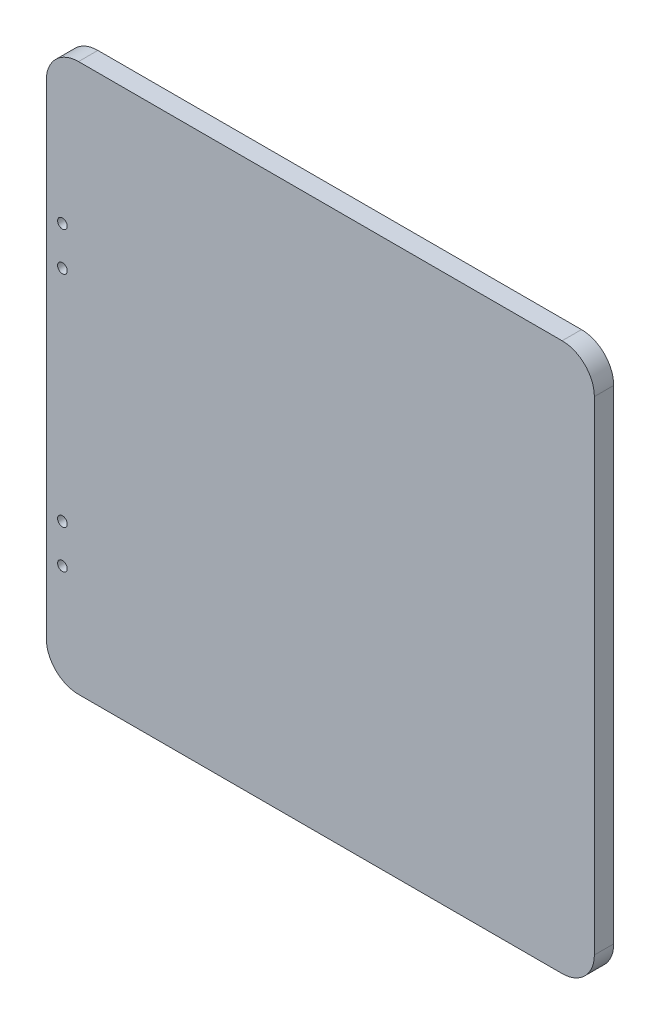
ISO-10303-21;
HEADER;
FILE_DESCRIPTION(('STEP AP214'),'2;1');
FILE_NAME('part.step','',(''),(''),'','','');
FILE_SCHEMA(('AUTOMOTIVE_DESIGN { 1 0 10303 214 1 1 1 1 }'));
ENDSEC;
DATA;
#1=APPLICATION_CONTEXT('core data for automotive mechanical design processes');
#2=APPLICATION_PROTOCOL_DEFINITION('international standard','automotive_design',2000,#1);
#3=PRODUCT_CONTEXT('',#1,'mechanical');
#4=PRODUCT('Part','Part','',(#3));
#5=PRODUCT_RELATED_PRODUCT_CATEGORY('part','',(#4));
#6=PRODUCT_DEFINITION_FORMATION('','',#4);
#7=PRODUCT_DEFINITION_CONTEXT('part definition',#1,'design');
#8=PRODUCT_DEFINITION('design','',#6,#7);
#9=PRODUCT_DEFINITION_SHAPE('','',#8);
#10=(LENGTH_UNIT() NAMED_UNIT(*) SI_UNIT(.MILLI.,.METRE.));
#11=(NAMED_UNIT(*) PLANE_ANGLE_UNIT() SI_UNIT($,.RADIAN.));
#12=(NAMED_UNIT(*) SI_UNIT($,.STERADIAN.) SOLID_ANGLE_UNIT());
#13=UNCERTAINTY_MEASURE_WITH_UNIT(LENGTH_MEASURE(1.E-05),#10,'distance_accuracy_value','');
#14=(GEOMETRIC_REPRESENTATION_CONTEXT(3) GLOBAL_UNCERTAINTY_ASSIGNED_CONTEXT((#13)) GLOBAL_UNIT_ASSIGNED_CONTEXT((#10,
#11,#12)) REPRESENTATION_CONTEXT('',''));
#15=CARTESIAN_POINT('',(0.,0.,0.));
#16=DIRECTION('',(0.,0.,1.));
#17=DIRECTION('',(1.,0.,0.));
#18=AXIS2_PLACEMENT_3D('',#15,#16,#17);
#19=CARTESIAN_POINT('',(-79.9999999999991,-53.,-0.00100000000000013));
#20=DIRECTION('',(0.,0.,1.));
#21=DIRECTION('',(1.,0.,0.));
#22=AXIS2_PLACEMENT_3D('',#19,#20,#21);
#23=CYLINDRICAL_SURFACE('',#22,1.5);
#24=CARTESIAN_POINT('',(-79.9999999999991,-53.,6.));
#25=DIRECTION('',(0.,0.,1.));
#26=DIRECTION('',(1.,0.,0.));
#27=AXIS2_PLACEMENT_3D('',#24,#25,#26);
#28=CIRCLE('',#27,1.5);
#29=CARTESIAN_POINT('',(-78.4999999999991,-53.,6.));
#30=VERTEX_POINT('',#29);
#31=EDGE_CURVE('E455',#30,#30,#28,.T.);
#32=CARTESIAN_POINT('',(-79.9999999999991,-53.,3.));
#33=DIRECTION('',(0.,0.,-1.));
#34=DIRECTION('',(-1.,0.,0.));
#35=AXIS2_PLACEMENT_3D('',#32,#33,#34);
#36=CIRCLE('',#35,1.5);
#37=CARTESIAN_POINT('',(-78.4999999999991,-53.,3.));
#38=VERTEX_POINT('',#37);
#39=EDGE_CURVE('E40',#38,#38,#36,.F.);
#40=CARTESIAN_POINT('',(-78.4999999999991,-53.,6.));
#41=CARTESIAN_POINT('',(-78.4999999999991,-53.,5.96875));
#42=CARTESIAN_POINT('',(-78.4999999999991,-53.,5.9375));
#43=CARTESIAN_POINT('',(-78.4999999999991,-53.,5.875));
#44=CARTESIAN_POINT('',(-78.4999999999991,-53.,5.84375));
#45=CARTESIAN_POINT('',(-78.4999999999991,-53.,5.78125));
#46=CARTESIAN_POINT('',(-78.4999999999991,-53.,5.75));
#47=CARTESIAN_POINT('',(-78.4999999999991,-53.,5.6875));
#48=CARTESIAN_POINT('',(-78.4999999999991,-53.,5.65625));
#49=CARTESIAN_POINT('',(-78.4999999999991,-53.,5.59375));
#50=CARTESIAN_POINT('',(-78.4999999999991,-53.,5.5625));
#51=CARTESIAN_POINT('',(-78.4999999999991,-53.,5.5));
#52=CARTESIAN_POINT('',(-78.4999999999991,-53.,5.46875));
#53=CARTESIAN_POINT('',(-78.4999999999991,-53.,5.40625));
#54=CARTESIAN_POINT('',(-78.4999999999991,-53.,5.375));
#55=CARTESIAN_POINT('',(-78.4999999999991,-53.,5.3125));
#56=CARTESIAN_POINT('',(-78.4999999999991,-53.,5.28125));
#57=CARTESIAN_POINT('',(-78.4999999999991,-53.,5.21875));
#58=CARTESIAN_POINT('',(-78.4999999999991,-53.,5.1875));
#59=CARTESIAN_POINT('',(-78.4999999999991,-53.,5.125));
#60=CARTESIAN_POINT('',(-78.4999999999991,-53.,5.09375));
#61=CARTESIAN_POINT('',(-78.4999999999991,-53.,5.03125));
#62=CARTESIAN_POINT('',(-78.4999999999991,-53.,5.));
#63=CARTESIAN_POINT('',(-78.4999999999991,-53.,4.9375));
#64=CARTESIAN_POINT('',(-78.4999999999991,-53.,4.90625));
#65=CARTESIAN_POINT('',(-78.4999999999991,-53.,4.84375));
#66=CARTESIAN_POINT('',(-78.4999999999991,-53.,4.8125));
#67=CARTESIAN_POINT('',(-78.4999999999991,-53.,4.75));
#68=CARTESIAN_POINT('',(-78.4999999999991,-53.,4.71875));
#69=CARTESIAN_POINT('',(-78.4999999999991,-53.,4.65625));
#70=CARTESIAN_POINT('',(-78.4999999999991,-53.,4.625));
#71=CARTESIAN_POINT('',(-78.4999999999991,-53.,4.5625));
#72=CARTESIAN_POINT('',(-78.4999999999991,-53.,4.53125));
#73=CARTESIAN_POINT('',(-78.4999999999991,-53.,4.46875));
#74=CARTESIAN_POINT('',(-78.4999999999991,-53.,4.4375));
#75=CARTESIAN_POINT('',(-78.4999999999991,-53.,4.375));
#76=CARTESIAN_POINT('',(-78.4999999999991,-53.,4.34375));
#77=CARTESIAN_POINT('',(-78.4999999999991,-53.,4.28125));
#78=CARTESIAN_POINT('',(-78.4999999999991,-53.,4.25));
#79=CARTESIAN_POINT('',(-78.4999999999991,-53.,4.1875));
#80=CARTESIAN_POINT('',(-78.4999999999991,-53.,4.15625));
#81=CARTESIAN_POINT('',(-78.4999999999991,-53.,4.09375));
#82=CARTESIAN_POINT('',(-78.4999999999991,-53.,4.0625));
#83=CARTESIAN_POINT('',(-78.4999999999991,-53.,4.));
#84=CARTESIAN_POINT('',(-78.4999999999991,-53.,3.96875));
#85=CARTESIAN_POINT('',(-78.4999999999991,-53.,3.90625));
#86=CARTESIAN_POINT('',(-78.4999999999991,-53.,3.875));
#87=CARTESIAN_POINT('',(-78.4999999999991,-53.,3.8125));
#88=CARTESIAN_POINT('',(-78.4999999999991,-53.,3.78125));
#89=CARTESIAN_POINT('',(-78.4999999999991,-53.,3.71875));
#90=CARTESIAN_POINT('',(-78.4999999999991,-53.,3.6875));
#91=CARTESIAN_POINT('',(-78.4999999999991,-53.,3.625));
#92=CARTESIAN_POINT('',(-78.4999999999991,-53.,3.59375));
#93=CARTESIAN_POINT('',(-78.4999999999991,-53.,3.53125));
#94=CARTESIAN_POINT('',(-78.4999999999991,-53.,3.5));
#95=CARTESIAN_POINT('',(-78.4999999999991,-53.,3.4375));
#96=CARTESIAN_POINT('',(-78.4999999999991,-53.,3.40625));
#97=CARTESIAN_POINT('',(-78.4999999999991,-53.,3.34375));
#98=CARTESIAN_POINT('',(-78.4999999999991,-53.,3.3125));
#99=CARTESIAN_POINT('',(-78.4999999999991,-53.,3.25));
#100=CARTESIAN_POINT('',(-78.4999999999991,-53.,3.21875));
#101=CARTESIAN_POINT('',(-78.4999999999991,-53.,3.15625));
#102=CARTESIAN_POINT('',(-78.4999999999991,-53.,3.125));
#103=CARTESIAN_POINT('',(-78.4999999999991,-53.,3.0625));
#104=CARTESIAN_POINT('',(-78.4999999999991,-53.,3.03125));
#105=CARTESIAN_POINT('',(-78.4999999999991,-53.,3.));
#106=B_SPLINE_CURVE_WITH_KNOTS('',3,(#40,#41,#42,#43,#44,#45,#46,#47,#48,#49,#50,#51,#52,#53,
#54,#55,#56,#57,#58,#59,#60,#61,#62,#63,#64,#65,#66,#67,#68,#69,#70,#71,#72,#73,#74,#75,#76,#77,
#78,#79,#80,#81,#82,#83,#84,#85,#86,#87,#88,#89,#90,#91,#92,#93,#94,#95,#96,#97,#98,#99,#100,
#101,#102,#103,#104,#105),.UNSPECIFIED.,.F.,.F.,(4,2,2,2,2,2,2,2,2,2,2,2,2,2,2,2,2,2,2,2,2,2,2,
2,2,2,2,2,2,2,2,2,4),(0.,0.0937500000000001,0.1875,0.28125,0.375,0.46875,0.5625,0.65625,0.75,
0.84375,0.9375,1.03125,1.125,1.21875,1.3125,1.40625,1.5,1.59375,1.6875,1.78125,1.875,1.96875,
2.0625,2.15625,2.25,2.34375,2.4375,2.53125,2.625,2.71875,2.8125,2.90625,3.),.UNSPECIFIED.);
#107=EDGE_CURVE('BSEAM36',#30,#38,#106,.T.);
#108=ORIENTED_EDGE('',*,*,#31,.T.);
#109=ORIENTED_EDGE('',*,*,#39,.F.);
#110=ORIENTED_EDGE('',*,*,#107,.T.);
#111=ORIENTED_EDGE('',*,*,#107,.F.);
#112=EDGE_LOOP('',(#108,#110,#109,#111));
#113=FACE_BOUND('',#112,.T.);
#114=ADVANCED_FACE('F36',(#113),#23,.F.);
#115=CARTESIAN_POINT('',(-79.9999999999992,-41.,-0.00100000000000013));
#116=DIRECTION('',(0.,0.,1.));
#117=DIRECTION('',(1.,0.,0.));
#118=AXIS2_PLACEMENT_3D('',#115,#116,#117);
#119=CYLINDRICAL_SURFACE('',#118,1.5);
#120=CARTESIAN_POINT('',(-79.9999999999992,-41.,6.));
#121=DIRECTION('',(0.,0.,1.));
#122=DIRECTION('',(1.,0.,0.));
#123=AXIS2_PLACEMENT_3D('',#120,#121,#122);
#124=CIRCLE('',#123,1.5);
#125=CARTESIAN_POINT('',(-78.4999999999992,-41.,6.));
#126=VERTEX_POINT('',#125);
#127=EDGE_CURVE('E452',#126,#126,#124,.T.);
#128=CARTESIAN_POINT('',(-79.9999999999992,-41.,3.));
#129=DIRECTION('',(0.,0.,-1.));
#130=DIRECTION('',(-1.,0.,0.));
#131=AXIS2_PLACEMENT_3D('',#128,#129,#130);
#132=CIRCLE('',#131,1.5);
#133=CARTESIAN_POINT('',(-78.4999999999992,-41.,3.));
#134=VERTEX_POINT('',#133);
#135=EDGE_CURVE('E517',#134,#134,#132,.F.);
#136=CARTESIAN_POINT('',(-78.4999999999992,-41.,6.));
#137=CARTESIAN_POINT('',(-78.4999999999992,-41.,5.96875));
#138=CARTESIAN_POINT('',(-78.4999999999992,-41.,5.9375));
#139=CARTESIAN_POINT('',(-78.4999999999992,-41.,5.875));
#140=CARTESIAN_POINT('',(-78.4999999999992,-41.,5.84375));
#141=CARTESIAN_POINT('',(-78.4999999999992,-41.,5.78125));
#142=CARTESIAN_POINT('',(-78.4999999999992,-41.,5.75));
#143=CARTESIAN_POINT('',(-78.4999999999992,-41.,5.6875));
#144=CARTESIAN_POINT('',(-78.4999999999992,-41.,5.65625));
#145=CARTESIAN_POINT('',(-78.4999999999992,-41.,5.59375));
#146=CARTESIAN_POINT('',(-78.4999999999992,-41.,5.5625));
#147=CARTESIAN_POINT('',(-78.4999999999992,-41.,5.5));
#148=CARTESIAN_POINT('',(-78.4999999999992,-41.,5.46875));
#149=CARTESIAN_POINT('',(-78.4999999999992,-41.,5.40625));
#150=CARTESIAN_POINT('',(-78.4999999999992,-41.,5.375));
#151=CARTESIAN_POINT('',(-78.4999999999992,-41.,5.3125));
#152=CARTESIAN_POINT('',(-78.4999999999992,-41.,5.28125));
#153=CARTESIAN_POINT('',(-78.4999999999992,-41.,5.21875));
#154=CARTESIAN_POINT('',(-78.4999999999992,-41.,5.1875));
#155=CARTESIAN_POINT('',(-78.4999999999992,-41.,5.125));
#156=CARTESIAN_POINT('',(-78.4999999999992,-41.,5.09375));
#157=CARTESIAN_POINT('',(-78.4999999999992,-41.,5.03125));
#158=CARTESIAN_POINT('',(-78.4999999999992,-41.,5.));
#159=CARTESIAN_POINT('',(-78.4999999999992,-41.,4.9375));
#160=CARTESIAN_POINT('',(-78.4999999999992,-41.,4.90625));
#161=CARTESIAN_POINT('',(-78.4999999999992,-41.,4.84375));
#162=CARTESIAN_POINT('',(-78.4999999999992,-41.,4.8125));
#163=CARTESIAN_POINT('',(-78.4999999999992,-41.,4.75));
#164=CARTESIAN_POINT('',(-78.4999999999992,-41.,4.71875));
#165=CARTESIAN_POINT('',(-78.4999999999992,-41.,4.65625));
#166=CARTESIAN_POINT('',(-78.4999999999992,-41.,4.625));
#167=CARTESIAN_POINT('',(-78.4999999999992,-41.,4.5625));
#168=CARTESIAN_POINT('',(-78.4999999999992,-41.,4.53125));
#169=CARTESIAN_POINT('',(-78.4999999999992,-41.,4.46875));
#170=CARTESIAN_POINT('',(-78.4999999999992,-41.,4.4375));
#171=CARTESIAN_POINT('',(-78.4999999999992,-41.,4.375));
#172=CARTESIAN_POINT('',(-78.4999999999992,-41.,4.34375));
#173=CARTESIAN_POINT('',(-78.4999999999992,-41.,4.28125));
#174=CARTESIAN_POINT('',(-78.4999999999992,-41.,4.25));
#175=CARTESIAN_POINT('',(-78.4999999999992,-41.,4.1875));
#176=CARTESIAN_POINT('',(-78.4999999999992,-41.,4.15625));
#177=CARTESIAN_POINT('',(-78.4999999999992,-41.,4.09375));
#178=CARTESIAN_POINT('',(-78.4999999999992,-41.,4.0625));
#179=CARTESIAN_POINT('',(-78.4999999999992,-41.,4.));
#180=CARTESIAN_POINT('',(-78.4999999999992,-41.,3.96875));
#181=CARTESIAN_POINT('',(-78.4999999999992,-41.,3.90625));
#182=CARTESIAN_POINT('',(-78.4999999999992,-41.,3.875));
#183=CARTESIAN_POINT('',(-78.4999999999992,-41.,3.8125));
#184=CARTESIAN_POINT('',(-78.4999999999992,-41.,3.78125));
#185=CARTESIAN_POINT('',(-78.4999999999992,-41.,3.71875));
#186=CARTESIAN_POINT('',(-78.4999999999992,-41.,3.6875));
#187=CARTESIAN_POINT('',(-78.4999999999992,-41.,3.625));
#188=CARTESIAN_POINT('',(-78.4999999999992,-41.,3.59375));
#189=CARTESIAN_POINT('',(-78.4999999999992,-41.,3.53125));
#190=CARTESIAN_POINT('',(-78.4999999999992,-41.,3.5));
#191=CARTESIAN_POINT('',(-78.4999999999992,-41.,3.4375));
#192=CARTESIAN_POINT('',(-78.4999999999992,-41.,3.40625));
#193=CARTESIAN_POINT('',(-78.4999999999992,-41.,3.34375));
#194=CARTESIAN_POINT('',(-78.4999999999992,-41.,3.3125));
#195=CARTESIAN_POINT('',(-78.4999999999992,-41.,3.25));
#196=CARTESIAN_POINT('',(-78.4999999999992,-41.,3.21875));
#197=CARTESIAN_POINT('',(-78.4999999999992,-41.,3.15625));
#198=CARTESIAN_POINT('',(-78.4999999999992,-41.,3.125));
#199=CARTESIAN_POINT('',(-78.4999999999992,-41.,3.0625));
#200=CARTESIAN_POINT('',(-78.4999999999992,-41.,3.03125));
#201=CARTESIAN_POINT('',(-78.4999999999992,-41.,3.));
#202=B_SPLINE_CURVE_WITH_KNOTS('',3,(#136,#137,#138,#139,#140,#141,#142,#143,#144,#145,#146,
#147,#148,#149,#150,#151,#152,#153,#154,#155,#156,#157,#158,#159,#160,#161,#162,#163,#164,#165,
#166,#167,#168,#169,#170,#171,#172,#173,#174,#175,#176,#177,#178,#179,#180,#181,#182,#183,#184,
#185,#186,#187,#188,#189,#190,#191,#192,#193,#194,#195,#196,#197,#198,#199,#200,#201),
.UNSPECIFIED.,.F.,.F.,(4,2,2,2,2,2,2,2,2,2,2,2,2,2,2,2,2,2,2,2,2,2,2,2,2,2,2,2,2,2,2,2,4),(0.,
0.0937500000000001,0.1875,0.28125,0.375,0.46875,0.5625,0.65625,0.75,0.84375,0.9375,1.03125,
1.125,1.21875,1.3125,1.40625,1.5,1.59375,1.6875,1.78125,1.875,1.96875,2.0625,2.15625,2.25,
2.34375,2.4375,2.53125,2.625,2.71875,2.8125,2.90625,3.),.UNSPECIFIED.);
#203=EDGE_CURVE('BSEAM527',#126,#134,#202,.T.);
#204=ORIENTED_EDGE('',*,*,#127,.T.);
#205=ORIENTED_EDGE('',*,*,#135,.F.);
#206=ORIENTED_EDGE('',*,*,#203,.T.);
#207=ORIENTED_EDGE('',*,*,#203,.F.);
#208=EDGE_LOOP('',(#204,#206,#205,#207));
#209=FACE_BOUND('',#208,.T.);
#210=ADVANCED_FACE('F527',(#209),#119,.F.);
#211=CARTESIAN_POINT('',(-79.9999999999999,27.,-0.00100000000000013));
#212=DIRECTION('',(0.,0.,1.));
#213=DIRECTION('',(1.,0.,0.));
#214=AXIS2_PLACEMENT_3D('',#211,#212,#213);
#215=CYLINDRICAL_SURFACE('',#214,1.5);
#216=CARTESIAN_POINT('',(-79.9999999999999,27.,6.));
#217=DIRECTION('',(0.,0.,1.));
#218=DIRECTION('',(1.,0.,0.));
#219=AXIS2_PLACEMENT_3D('',#216,#217,#218);
#220=CIRCLE('',#219,1.5);
#221=CARTESIAN_POINT('',(-78.4999999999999,27.,6.));
#222=VERTEX_POINT('',#221);
#223=EDGE_CURVE('E449',#222,#222,#220,.T.);
#224=CARTESIAN_POINT('',(-79.9999999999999,27.,3.));
#225=DIRECTION('',(0.,0.,-1.));
#226=DIRECTION('',(-1.,0.,0.));
#227=AXIS2_PLACEMENT_3D('',#224,#225,#226);
#228=CIRCLE('',#227,1.5);
#229=CARTESIAN_POINT('',(-78.4999999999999,27.,3.));
#230=VERTEX_POINT('',#229);
#231=EDGE_CURVE('E515',#230,#230,#228,.F.);
#232=CARTESIAN_POINT('',(-78.4999999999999,27.,6.));
#233=CARTESIAN_POINT('',(-78.4999999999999,27.,5.96875));
#234=CARTESIAN_POINT('',(-78.4999999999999,27.,5.9375));
#235=CARTESIAN_POINT('',(-78.4999999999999,27.,5.875));
#236=CARTESIAN_POINT('',(-78.4999999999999,27.,5.84375));
#237=CARTESIAN_POINT('',(-78.4999999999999,27.,5.78125));
#238=CARTESIAN_POINT('',(-78.4999999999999,27.,5.75));
#239=CARTESIAN_POINT('',(-78.4999999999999,27.,5.6875));
#240=CARTESIAN_POINT('',(-78.4999999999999,27.,5.65625));
#241=CARTESIAN_POINT('',(-78.4999999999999,27.,5.59375));
#242=CARTESIAN_POINT('',(-78.4999999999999,27.,5.5625));
#243=CARTESIAN_POINT('',(-78.4999999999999,27.,5.5));
#244=CARTESIAN_POINT('',(-78.4999999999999,27.,5.46875));
#245=CARTESIAN_POINT('',(-78.4999999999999,27.,5.40625));
#246=CARTESIAN_POINT('',(-78.4999999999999,27.,5.375));
#247=CARTESIAN_POINT('',(-78.4999999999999,27.,5.3125));
#248=CARTESIAN_POINT('',(-78.4999999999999,27.,5.28125));
#249=CARTESIAN_POINT('',(-78.4999999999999,27.,5.21875));
#250=CARTESIAN_POINT('',(-78.4999999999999,27.,5.1875));
#251=CARTESIAN_POINT('',(-78.4999999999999,27.,5.125));
#252=CARTESIAN_POINT('',(-78.4999999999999,27.,5.09375));
#253=CARTESIAN_POINT('',(-78.4999999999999,27.,5.03125));
#254=CARTESIAN_POINT('',(-78.4999999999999,27.,5.));
#255=CARTESIAN_POINT('',(-78.4999999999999,27.,4.9375));
#256=CARTESIAN_POINT('',(-78.4999999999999,27.,4.90625));
#257=CARTESIAN_POINT('',(-78.4999999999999,27.,4.84375));
#258=CARTESIAN_POINT('',(-78.4999999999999,27.,4.8125));
#259=CARTESIAN_POINT('',(-78.4999999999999,27.,4.75));
#260=CARTESIAN_POINT('',(-78.4999999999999,27.,4.71875));
#261=CARTESIAN_POINT('',(-78.4999999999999,27.,4.65625));
#262=CARTESIAN_POINT('',(-78.4999999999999,27.,4.625));
#263=CARTESIAN_POINT('',(-78.4999999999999,27.,4.5625));
#264=CARTESIAN_POINT('',(-78.4999999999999,27.,4.53125));
#265=CARTESIAN_POINT('',(-78.4999999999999,27.,4.46875));
#266=CARTESIAN_POINT('',(-78.4999999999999,27.,4.4375));
#267=CARTESIAN_POINT('',(-78.4999999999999,27.,4.375));
#268=CARTESIAN_POINT('',(-78.4999999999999,27.,4.34375));
#269=CARTESIAN_POINT('',(-78.4999999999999,27.,4.28125));
#270=CARTESIAN_POINT('',(-78.4999999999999,27.,4.25));
#271=CARTESIAN_POINT('',(-78.4999999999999,27.,4.1875));
#272=CARTESIAN_POINT('',(-78.4999999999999,27.,4.15625));
#273=CARTESIAN_POINT('',(-78.4999999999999,27.,4.09375));
#274=CARTESIAN_POINT('',(-78.4999999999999,27.,4.0625));
#275=CARTESIAN_POINT('',(-78.4999999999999,27.,4.));
#276=CARTESIAN_POINT('',(-78.4999999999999,27.,3.96875));
#277=CARTESIAN_POINT('',(-78.4999999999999,27.,3.90625));
#278=CARTESIAN_POINT('',(-78.4999999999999,27.,3.875));
#279=CARTESIAN_POINT('',(-78.4999999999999,27.,3.8125));
#280=CARTESIAN_POINT('',(-78.4999999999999,27.,3.78125));
#281=CARTESIAN_POINT('',(-78.4999999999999,27.,3.71875));
#282=CARTESIAN_POINT('',(-78.4999999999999,27.,3.6875));
#283=CARTESIAN_POINT('',(-78.4999999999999,27.,3.625));
#284=CARTESIAN_POINT('',(-78.4999999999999,27.,3.59375));
#285=CARTESIAN_POINT('',(-78.4999999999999,27.,3.53125));
#286=CARTESIAN_POINT('',(-78.4999999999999,27.,3.5));
#287=CARTESIAN_POINT('',(-78.4999999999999,27.,3.4375));
#288=CARTESIAN_POINT('',(-78.4999999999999,27.,3.40625));
#289=CARTESIAN_POINT('',(-78.4999999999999,27.,3.34375));
#290=CARTESIAN_POINT('',(-78.4999999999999,27.,3.3125));
#291=CARTESIAN_POINT('',(-78.4999999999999,27.,3.25));
#292=CARTESIAN_POINT('',(-78.4999999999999,27.,3.21875));
#293=CARTESIAN_POINT('',(-78.4999999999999,27.,3.15625));
#294=CARTESIAN_POINT('',(-78.4999999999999,27.,3.125));
#295=CARTESIAN_POINT('',(-78.4999999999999,27.,3.0625));
#296=CARTESIAN_POINT('',(-78.4999999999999,27.,3.03125));
#297=CARTESIAN_POINT('',(-78.4999999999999,27.,3.));
#298=B_SPLINE_CURVE_WITH_KNOTS('',3,(#232,#233,#234,#235,#236,#237,#238,#239,#240,#241,#242,
#243,#244,#245,#246,#247,#248,#249,#250,#251,#252,#253,#254,#255,#256,#257,#258,#259,#260,#261,
#262,#263,#264,#265,#266,#267,#268,#269,#270,#271,#272,#273,#274,#275,#276,#277,#278,#279,#280,
#281,#282,#283,#284,#285,#286,#287,#288,#289,#290,#291,#292,#293,#294,#295,#296,#297),
.UNSPECIFIED.,.F.,.F.,(4,2,2,2,2,2,2,2,2,2,2,2,2,2,2,2,2,2,2,2,2,2,2,2,2,2,2,2,2,2,2,2,4),(0.,
0.0937500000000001,0.1875,0.28125,0.375,0.46875,0.5625,0.65625,0.75,0.84375,0.9375,1.03125,
1.125,1.21875,1.3125,1.40625,1.5,1.59375,1.6875,1.78125,1.875,1.96875,2.0625,2.15625,2.25,
2.34375,2.4375,2.53125,2.625,2.71875,2.8125,2.90625,3.),.UNSPECIFIED.);
#299=EDGE_CURVE('BSEAM534',#222,#230,#298,.T.);
#300=ORIENTED_EDGE('',*,*,#223,.T.);
#301=ORIENTED_EDGE('',*,*,#231,.F.);
#302=ORIENTED_EDGE('',*,*,#299,.T.);
#303=ORIENTED_EDGE('',*,*,#299,.F.);
#304=EDGE_LOOP('',(#300,#302,#301,#303));
#305=FACE_BOUND('',#304,.T.);
#306=ADVANCED_FACE('F534',(#305),#215,.F.);
#307=CARTESIAN_POINT('',(-80.,39.,-0.00100000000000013));
#308=DIRECTION('',(0.,0.,1.));
#309=DIRECTION('',(1.,0.,0.));
#310=AXIS2_PLACEMENT_3D('',#307,#308,#309);
#311=CYLINDRICAL_SURFACE('',#310,1.5);
#312=CARTESIAN_POINT('',(-80.,39.,6.));
#313=DIRECTION('',(0.,0.,1.));
#314=DIRECTION('',(1.,0.,0.));
#315=AXIS2_PLACEMENT_3D('',#312,#313,#314);
#316=CIRCLE('',#315,1.5);
#317=CARTESIAN_POINT('',(-78.5,39.,6.));
#318=VERTEX_POINT('',#317);
#319=EDGE_CURVE('E445',#318,#318,#316,.T.);
#320=CARTESIAN_POINT('',(-80.,39.,3.));
#321=DIRECTION('',(0.,0.,-1.));
#322=DIRECTION('',(-1.,0.,0.));
#323=AXIS2_PLACEMENT_3D('',#320,#321,#322);
#324=CIRCLE('',#323,1.5);
#325=CARTESIAN_POINT('',(-78.5,39.,3.));
#326=VERTEX_POINT('',#325);
#327=EDGE_CURVE('E296',#326,#326,#324,.F.);
#328=CARTESIAN_POINT('',(-78.5,39.,6.));
#329=CARTESIAN_POINT('',(-78.5,39.,5.96875));
#330=CARTESIAN_POINT('',(-78.5,39.,5.9375));
#331=CARTESIAN_POINT('',(-78.5,39.,5.875));
#332=CARTESIAN_POINT('',(-78.5,39.,5.84375));
#333=CARTESIAN_POINT('',(-78.5,39.,5.78125));
#334=CARTESIAN_POINT('',(-78.5,39.,5.75));
#335=CARTESIAN_POINT('',(-78.5,39.,5.6875));
#336=CARTESIAN_POINT('',(-78.5,39.,5.65625));
#337=CARTESIAN_POINT('',(-78.5,39.,5.59375));
#338=CARTESIAN_POINT('',(-78.5,39.,5.5625));
#339=CARTESIAN_POINT('',(-78.5,39.,5.5));
#340=CARTESIAN_POINT('',(-78.5,39.,5.46875));
#341=CARTESIAN_POINT('',(-78.5,39.,5.40625));
#342=CARTESIAN_POINT('',(-78.5,39.,5.375));
#343=CARTESIAN_POINT('',(-78.5,39.,5.3125));
#344=CARTESIAN_POINT('',(-78.5,39.,5.28125));
#345=CARTESIAN_POINT('',(-78.5,39.,5.21875));
#346=CARTESIAN_POINT('',(-78.5,39.,5.1875));
#347=CARTESIAN_POINT('',(-78.5,39.,5.125));
#348=CARTESIAN_POINT('',(-78.5,39.,5.09375));
#349=CARTESIAN_POINT('',(-78.5,39.,5.03125));
#350=CARTESIAN_POINT('',(-78.5,39.,5.));
#351=CARTESIAN_POINT('',(-78.5,39.,4.9375));
#352=CARTESIAN_POINT('',(-78.5,39.,4.90625));
#353=CARTESIAN_POINT('',(-78.5,39.,4.84375));
#354=CARTESIAN_POINT('',(-78.5,39.,4.8125));
#355=CARTESIAN_POINT('',(-78.5,39.,4.75));
#356=CARTESIAN_POINT('',(-78.5,39.,4.71875));
#357=CARTESIAN_POINT('',(-78.5,39.,4.65625));
#358=CARTESIAN_POINT('',(-78.5,39.,4.625));
#359=CARTESIAN_POINT('',(-78.5,39.,4.5625));
#360=CARTESIAN_POINT('',(-78.5,39.,4.53125));
#361=CARTESIAN_POINT('',(-78.5,39.,4.46875));
#362=CARTESIAN_POINT('',(-78.5,39.,4.4375));
#363=CARTESIAN_POINT('',(-78.5,39.,4.375));
#364=CARTESIAN_POINT('',(-78.5,39.,4.34375));
#365=CARTESIAN_POINT('',(-78.5,39.,4.28125));
#366=CARTESIAN_POINT('',(-78.5,39.,4.25));
#367=CARTESIAN_POINT('',(-78.5,39.,4.1875));
#368=CARTESIAN_POINT('',(-78.5,39.,4.15625));
#369=CARTESIAN_POINT('',(-78.5,39.,4.09375));
#370=CARTESIAN_POINT('',(-78.5,39.,4.0625));
#371=CARTESIAN_POINT('',(-78.5,39.,4.));
#372=CARTESIAN_POINT('',(-78.5,39.,3.96875));
#373=CARTESIAN_POINT('',(-78.5,39.,3.90625));
#374=CARTESIAN_POINT('',(-78.5,39.,3.875));
#375=CARTESIAN_POINT('',(-78.5,39.,3.8125));
#376=CARTESIAN_POINT('',(-78.5,39.,3.78125));
#377=CARTESIAN_POINT('',(-78.5,39.,3.71875));
#378=CARTESIAN_POINT('',(-78.5,39.,3.6875));
#379=CARTESIAN_POINT('',(-78.5,39.,3.625));
#380=CARTESIAN_POINT('',(-78.5,39.,3.59375));
#381=CARTESIAN_POINT('',(-78.5,39.,3.53125));
#382=CARTESIAN_POINT('',(-78.5,39.,3.5));
#383=CARTESIAN_POINT('',(-78.5,39.,3.4375));
#384=CARTESIAN_POINT('',(-78.5,39.,3.40625));
#385=CARTESIAN_POINT('',(-78.5,39.,3.34375));
#386=CARTESIAN_POINT('',(-78.5,39.,3.3125));
#387=CARTESIAN_POINT('',(-78.5,39.,3.25));
#388=CARTESIAN_POINT('',(-78.5,39.,3.21875));
#389=CARTESIAN_POINT('',(-78.5,39.,3.15625));
#390=CARTESIAN_POINT('',(-78.5,39.,3.125));
#391=CARTESIAN_POINT('',(-78.5,39.,3.0625));
#392=CARTESIAN_POINT('',(-78.5,39.,3.03125));
#393=CARTESIAN_POINT('',(-78.5,39.,3.));
#394=B_SPLINE_CURVE_WITH_KNOTS('',3,(#328,#329,#330,#331,#332,#333,#334,#335,#336,#337,#338,
#339,#340,#341,#342,#343,#344,#345,#346,#347,#348,#349,#350,#351,#352,#353,#354,#355,#356,#357,
#358,#359,#360,#361,#362,#363,#364,#365,#366,#367,#368,#369,#370,#371,#372,#373,#374,#375,#376,
#377,#378,#379,#380,#381,#382,#383,#384,#385,#386,#387,#388,#389,#390,#391,#392,#393),
.UNSPECIFIED.,.F.,.F.,(4,2,2,2,2,2,2,2,2,2,2,2,2,2,2,2,2,2,2,2,2,2,2,2,2,2,2,2,2,2,2,2,4),(0.,
0.0937500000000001,0.1875,0.28125,0.375,0.46875,0.5625,0.65625,0.75,0.84375,0.9375,1.03125,
1.125,1.21875,1.3125,1.40625,1.5,1.59375,1.6875,1.78125,1.875,1.96875,2.0625,2.15625,2.25,
2.34375,2.4375,2.53125,2.625,2.71875,2.8125,2.90625,3.),.UNSPECIFIED.);
#395=EDGE_CURVE('BSEAM562',#318,#326,#394,.T.);
#396=ORIENTED_EDGE('',*,*,#319,.T.);
#397=ORIENTED_EDGE('',*,*,#327,.F.);
#398=ORIENTED_EDGE('',*,*,#395,.T.);
#399=ORIENTED_EDGE('',*,*,#395,.F.);
#400=EDGE_LOOP('',(#396,#398,#397,#399));
#401=FACE_BOUND('',#400,.T.);
#402=ADVANCED_FACE('F562',(#401),#311,.F.);
#403=CARTESIAN_POINT('',(-85.,-85.,6.));
#404=DIRECTION('',(1.,0.,0.));
#405=DIRECTION('',(0.,0.,-1.));
#406=AXIS2_PLACEMENT_3D('',#403,#404,#405);
#407=PLANE('',#406);
#408=DIRECTION('',(0.,-1.,0.));
#409=VECTOR('',#408,1.);
#410=CARTESIAN_POINT('',(-85.,-85.,0.));
#411=LINE('',#410,#409);
#412=CARTESIAN_POINT('',(-85.,75.,0.));
#413=VERTEX_POINT('',#412);
#414=CARTESIAN_POINT('',(-85.,-75.,0.));
#415=VERTEX_POINT('',#414);
#416=EDGE_CURVE('E448',#413,#415,#411,.T.);
#417=ORIENTED_EDGE('',*,*,#416,.T.);
#418=DIRECTION('',(0.,0.,-1.));
#419=VECTOR('',#418,1.);
#420=CARTESIAN_POINT('',(-85.,-75.,6.));
#421=LINE('',#420,#419);
#422=CARTESIAN_POINT('',(-85.,-75.,6.));
#423=VERTEX_POINT('',#422);
#424=EDGE_CURVE('E497',#415,#423,#421,.F.);
#425=ORIENTED_EDGE('',*,*,#424,.T.);
#426=DIRECTION('',(0.,-1.,0.));
#427=VECTOR('',#426,1.);
#428=CARTESIAN_POINT('',(-85.,-85.,6.));
#429=LINE('',#428,#427);
#430=CARTESIAN_POINT('',(-85.,75.,6.));
#431=VERTEX_POINT('',#430);
#432=EDGE_CURVE('E458',#431,#423,#429,.T.);
#433=ORIENTED_EDGE('',*,*,#432,.F.);
#434=DIRECTION('',(0.,0.,-1.));
#435=VECTOR('',#434,1.);
#436=CARTESIAN_POINT('',(-85.,75.,6.));
#437=LINE('',#436,#435);
#438=EDGE_CURVE('E494',#431,#413,#437,.T.);
#439=ORIENTED_EDGE('',*,*,#438,.T.);
#440=EDGE_LOOP('',(#417,#425,#433,#439));
#441=FACE_BOUND('',#440,.T.);
#442=ADVANCED_FACE('F558',(#441),#407,.F.);
#443=CARTESIAN_POINT('',(85.,-85.,6.));
#444=DIRECTION('',(0.,1.,0.));
#445=DIRECTION('',(-1.,0.,0.));
#446=AXIS2_PLACEMENT_3D('',#443,#444,#445);
#447=PLANE('',#446);
#448=DIRECTION('',(1.,0.,0.));
#449=VECTOR('',#448,1.);
#450=CARTESIAN_POINT('',(85.,-85.,6.));
#451=LINE('',#450,#449);
#452=CARTESIAN_POINT('',(-75.,-85.,6.));
#453=VERTEX_POINT('',#452);
#454=CARTESIAN_POINT('',(75.,-85.,6.));
#455=VERTEX_POINT('',#454);
#456=EDGE_CURVE('E461',#453,#455,#451,.T.);
#457=ORIENTED_EDGE('',*,*,#456,.F.);
#458=DIRECTION('',(0.,0.,-1.));
#459=VECTOR('',#458,1.);
#460=CARTESIAN_POINT('',(-75.,-85.,6.));
#461=LINE('',#460,#459);
#462=CARTESIAN_POINT('',(-75.,-85.,0.));
#463=VERTEX_POINT('',#462);
#464=EDGE_CURVE('E483',#453,#463,#461,.T.);
#465=ORIENTED_EDGE('',*,*,#464,.T.);
#466=DIRECTION('',(1.,0.,0.));
#467=VECTOR('',#466,1.);
#468=CARTESIAN_POINT('',(85.,-85.,0.));
#469=LINE('',#468,#467);
#470=CARTESIAN_POINT('',(75.,-85.,0.));
#471=VERTEX_POINT('',#470);
#472=EDGE_CURVE('E474',#463,#471,#469,.T.);
#473=ORIENTED_EDGE('',*,*,#472,.T.);
#474=DIRECTION('',(0.,0.,-1.));
#475=VECTOR('',#474,1.);
#476=CARTESIAN_POINT('',(75.,-85.,6.));
#477=LINE('',#476,#475);
#478=EDGE_CURVE('E471',#471,#455,#477,.F.);
#479=ORIENTED_EDGE('',*,*,#478,.T.);
#480=EDGE_LOOP('',(#457,#465,#473,#479));
#481=FACE_BOUND('',#480,.T.);
#482=ADVANCED_FACE('F554',(#481),#447,.F.);
#483=CARTESIAN_POINT('',(85.,-85.,6.));
#484=DIRECTION('',(-1.,0.,0.));
#485=DIRECTION('',(0.,0.,1.));
#486=AXIS2_PLACEMENT_3D('',#483,#484,#485);
#487=PLANE('',#486);
#488=DIRECTION('',(0.,1.,0.));
#489=VECTOR('',#488,1.);
#490=CARTESIAN_POINT('',(85.,-85.,6.));
#491=LINE('',#490,#489);
#492=CARTESIAN_POINT('',(85.,-75.,6.));
#493=VERTEX_POINT('',#492);
#494=CARTESIAN_POINT('',(85.,75.,6.));
#495=VERTEX_POINT('',#494);
#496=EDGE_CURVE('E465',#493,#495,#491,.T.);
#497=ORIENTED_EDGE('',*,*,#496,.F.);
#498=DIRECTION('',(0.,0.,-1.));
#499=VECTOR('',#498,1.);
#500=CARTESIAN_POINT('',(85.,-75.,6.));
#501=LINE('',#500,#499);
#502=CARTESIAN_POINT('',(85.,-75.,0.));
#503=VERTEX_POINT('',#502);
#504=EDGE_CURVE('E509',#493,#503,#501,.T.);
#505=ORIENTED_EDGE('',*,*,#504,.T.);
#506=DIRECTION('',(0.,1.,0.));
#507=VECTOR('',#506,1.);
#508=CARTESIAN_POINT('',(85.,-85.,0.));
#509=LINE('',#508,#507);
#510=CARTESIAN_POINT('',(85.,75.,0.));
#511=VERTEX_POINT('',#510);
#512=EDGE_CURVE('E477',#503,#511,#509,.T.);
#513=ORIENTED_EDGE('',*,*,#512,.T.);
#514=DIRECTION('',(0.,0.,-1.));
#515=VECTOR('',#514,1.);
#516=CARTESIAN_POINT('',(85.,75.,6.));
#517=LINE('',#516,#515);
#518=EDGE_CURVE('E507',#511,#495,#517,.F.);
#519=ORIENTED_EDGE('',*,*,#518,.T.);
#520=EDGE_LOOP('',(#497,#505,#513,#519));
#521=FACE_BOUND('',#520,.T.);
#522=ADVANCED_FACE('F550',(#521),#487,.F.);
#523=CARTESIAN_POINT('',(85.,85.,6.));
#524=DIRECTION('',(0.,-1.,0.));
#525=DIRECTION('',(1.,0.,0.));
#526=AXIS2_PLACEMENT_3D('',#523,#524,#525);
#527=PLANE('',#526);
#528=DIRECTION('',(-1.,0.,0.));
#529=VECTOR('',#528,1.);
#530=CARTESIAN_POINT('',(85.,85.,6.));
#531=LINE('',#530,#529);
#532=CARTESIAN_POINT('',(75.,85.,6.));
#533=VERTEX_POINT('',#532);
#534=CARTESIAN_POINT('',(-75.,85.,6.));
#535=VERTEX_POINT('',#534);
#536=EDGE_CURVE('E468',#533,#535,#531,.T.);
#537=ORIENTED_EDGE('',*,*,#536,.F.);
#538=DIRECTION('',(0.,0.,-1.));
#539=VECTOR('',#538,1.);
#540=CARTESIAN_POINT('',(75.,85.,6.));
#541=LINE('',#540,#539);
#542=CARTESIAN_POINT('',(75.,85.,0.));
#543=VERTEX_POINT('',#542);
#544=EDGE_CURVE('E11',#533,#543,#541,.T.);
#545=ORIENTED_EDGE('',*,*,#544,.T.);
#546=DIRECTION('',(-1.,0.,0.));
#547=VECTOR('',#546,1.);
#548=CARTESIAN_POINT('',(85.,85.,0.));
#549=LINE('',#548,#547);
#550=CARTESIAN_POINT('',(-75.,85.,0.));
#551=VERTEX_POINT('',#550);
#552=EDGE_CURVE('E462',#543,#551,#549,.T.);
#553=ORIENTED_EDGE('',*,*,#552,.T.);
#554=DIRECTION('',(0.,0.,-1.));
#555=VECTOR('',#554,1.);
#556=CARTESIAN_POINT('',(-75.,85.,6.));
#557=LINE('',#556,#555);
#558=EDGE_CURVE('E45',#551,#535,#557,.F.);
#559=ORIENTED_EDGE('',*,*,#558,.T.);
#560=EDGE_LOOP('',(#537,#545,#553,#559));
#561=FACE_BOUND('',#560,.T.);
#562=ADVANCED_FACE('F542',(#561),#527,.F.);
#563=CARTESIAN_POINT('',(0.,0.,6.));
#564=DIRECTION('',(0.,0.,1.));
#565=DIRECTION('',(1.,0.,0.));
#566=AXIS2_PLACEMENT_3D('',#563,#564,#565);
#567=PLANE('',#566);
#568=ORIENTED_EDGE('',*,*,#319,.F.);
#569=EDGE_LOOP('',(#568));
#570=FACE_BOUND('',#569,.T.);
#571=ORIENTED_EDGE('',*,*,#223,.F.);
#572=EDGE_LOOP('',(#571));
#573=FACE_BOUND('',#572,.T.);
#574=ORIENTED_EDGE('',*,*,#127,.F.);
#575=EDGE_LOOP('',(#574));
#576=FACE_BOUND('',#575,.T.);
#577=ORIENTED_EDGE('',*,*,#31,.F.);
#578=EDGE_LOOP('',(#577));
#579=FACE_BOUND('',#578,.T.);
#580=ORIENTED_EDGE('',*,*,#432,.T.);
#581=CARTESIAN_POINT('',(-75.,-75.,6.));
#582=DIRECTION('',(0.,0.,1.));
#583=DIRECTION('',(1.,0.,0.));
#584=AXIS2_PLACEMENT_3D('',#581,#582,#583);
#585=CIRCLE('',#584,10.);
#586=EDGE_CURVE('E505',#423,#453,#585,.T.);
#587=ORIENTED_EDGE('',*,*,#586,.T.);
#588=ORIENTED_EDGE('',*,*,#456,.T.);
#589=CARTESIAN_POINT('',(75.,-75.,6.));
#590=DIRECTION('',(0.,0.,1.));
#591=DIRECTION('',(1.,0.,0.));
#592=AXIS2_PLACEMENT_3D('',#589,#590,#591);
#593=CIRCLE('',#592,10.);
#594=EDGE_CURVE('E503',#455,#493,#593,.T.);
#595=ORIENTED_EDGE('',*,*,#594,.T.);
#596=ORIENTED_EDGE('',*,*,#496,.T.);
#597=CARTESIAN_POINT('',(75.,75.,6.));
#598=DIRECTION('',(0.,0.,1.));
#599=DIRECTION('',(1.,0.,0.));
#600=AXIS2_PLACEMENT_3D('',#597,#598,#599);
#601=CIRCLE('',#600,10.);
#602=EDGE_CURVE('E501',#495,#533,#601,.T.);
#603=ORIENTED_EDGE('',*,*,#602,.T.);
#604=ORIENTED_EDGE('',*,*,#536,.T.);
#605=CARTESIAN_POINT('',(-75.,75.,6.));
#606=DIRECTION('',(0.,0.,1.));
#607=DIRECTION('',(1.,0.,0.));
#608=AXIS2_PLACEMENT_3D('',#605,#606,#607);
#609=CIRCLE('',#608,10.);
#610=EDGE_CURVE('E499',#535,#431,#609,.T.);
#611=ORIENTED_EDGE('',*,*,#610,.T.);
#612=EDGE_LOOP('',(#580,#587,#588,#595,#596,#603,#604,#611));
#613=FACE_BOUND('',#612,.T.);
#614=ADVANCED_FACE('F539',(#570,#573,#576,#579,#613),#567,.T.);
#615=CARTESIAN_POINT('',(0.,0.,0.));
#616=DIRECTION('',(0.,0.,1.));
#617=DIRECTION('',(1.,0.,0.));
#618=AXIS2_PLACEMENT_3D('',#615,#616,#617);
#619=PLANE('',#618);
#620=DIRECTION('',(0.,-1.,0.));
#621=VECTOR('',#620,1.);
#622=CARTESIAN_POINT('',(-77.25,40.5877132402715,0.));
#623=LINE('',#622,#621);
#624=CARTESIAN_POINT('',(-77.25,40.5877132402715,0.));
#625=VERTEX_POINT('',#624);
#626=CARTESIAN_POINT('',(-77.25,37.4122867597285,0.));
#627=VERTEX_POINT('',#626);
#628=EDGE_CURVE('E283',#625,#627,#623,.T.);
#629=ORIENTED_EDGE('',*,*,#628,.F.);
#630=DIRECTION('',(0.866025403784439,-0.499999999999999,0.));
#631=VECTOR('',#630,1.);
#632=CARTESIAN_POINT('',(-80.,42.175426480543,0.));
#633=LINE('',#632,#631);
#634=CARTESIAN_POINT('',(-80.,42.175426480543,0.));
#635=VERTEX_POINT('',#634);
#636=EDGE_CURVE('E53',#635,#625,#633,.T.);
#637=ORIENTED_EDGE('',*,*,#636,.F.);
#638=DIRECTION('',(0.866025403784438,0.5,0.));
#639=VECTOR('',#638,1.);
#640=CARTESIAN_POINT('',(-82.75,40.5877132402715,0.));
#641=LINE('',#640,#639);
#642=CARTESIAN_POINT('',(-82.75,40.5877132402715,0.));
#643=VERTEX_POINT('',#642);
#644=EDGE_CURVE('E269',#643,#635,#641,.T.);
#645=ORIENTED_EDGE('',*,*,#644,.F.);
#646=DIRECTION('',(0.,1.,0.));
#647=VECTOR('',#646,1.);
#648=CARTESIAN_POINT('',(-82.75,37.4122867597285,0.));
#649=LINE('',#648,#647);
#650=CARTESIAN_POINT('',(-82.75,37.4122867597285,0.));
#651=VERTEX_POINT('',#650);
#652=EDGE_CURVE('E272',#651,#643,#649,.T.);
#653=ORIENTED_EDGE('',*,*,#652,.F.);
#654=DIRECTION('',(-0.866025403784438,0.500000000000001,0.));
#655=VECTOR('',#654,1.);
#656=CARTESIAN_POINT('',(-80.,35.8245735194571,0.));
#657=LINE('',#656,#655);
#658=CARTESIAN_POINT('',(-80.,35.8245735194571,0.));
#659=VERTEX_POINT('',#658);
#660=EDGE_CURVE('E289',#659,#651,#657,.T.);
#661=ORIENTED_EDGE('',*,*,#660,.F.);
#662=DIRECTION('',(-0.866025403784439,-0.499999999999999,0.));
#663=VECTOR('',#662,1.);
#664=CARTESIAN_POINT('',(-77.25,37.4122867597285,0.));
#665=LINE('',#664,#663);
#666=EDGE_CURVE('E286',#627,#659,#665,.T.);
#667=ORIENTED_EDGE('',*,*,#666,.F.);
#668=EDGE_LOOP('',(#629,#637,#645,#653,#661,#667));
#669=FACE_BOUND('',#668,.T.);
#670=DIRECTION('',(0.,-1.,0.));
#671=VECTOR('',#670,1.);
#672=CARTESIAN_POINT('',(-77.2499999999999,28.5877132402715,0.));
#673=LINE('',#672,#671);
#674=CARTESIAN_POINT('',(-77.2499999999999,28.5877132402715,0.));
#675=VERTEX_POINT('',#674);
#676=CARTESIAN_POINT('',(-77.2499999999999,25.4122867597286,0.));
#677=VERTEX_POINT('',#676);
#678=EDGE_CURVE('E325',#675,#677,#673,.T.);
#679=ORIENTED_EDGE('',*,*,#678,.F.);
#680=DIRECTION('',(0.866025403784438,-0.500000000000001,0.));
#681=VECTOR('',#680,1.);
#682=CARTESIAN_POINT('',(-79.9999999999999,30.175426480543,0.));
#683=LINE('',#682,#681);
#684=CARTESIAN_POINT('',(-79.9999999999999,30.175426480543,0.));
#685=VERTEX_POINT('',#684);
#686=EDGE_CURVE('E61',#685,#675,#683,.T.);
#687=ORIENTED_EDGE('',*,*,#686,.F.);
#688=DIRECTION('',(0.866025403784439,0.499999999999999,0.));
#689=VECTOR('',#688,1.);
#690=CARTESIAN_POINT('',(-82.7499999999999,28.5877132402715,0.));
#691=LINE('',#690,#689);
#692=CARTESIAN_POINT('',(-82.7499999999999,28.5877132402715,0.));
#693=VERTEX_POINT('',#692);
#694=EDGE_CURVE('E308',#693,#685,#691,.T.);
#695=ORIENTED_EDGE('',*,*,#694,.F.);
#696=DIRECTION('',(0.,1.,0.));
#697=VECTOR('',#696,1.);
#698=CARTESIAN_POINT('',(-82.7499999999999,25.4122867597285,0.));
#699=LINE('',#698,#697);
#700=CARTESIAN_POINT('',(-82.7499999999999,25.4122867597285,0.));
#701=VERTEX_POINT('',#700);
#702=EDGE_CURVE('E335',#701,#693,#699,.T.);
#703=ORIENTED_EDGE('',*,*,#702,.F.);
#704=DIRECTION('',(-0.866025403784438,0.500000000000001,0.));
#705=VECTOR('',#704,1.);
#706=CARTESIAN_POINT('',(-79.9999999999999,23.8245735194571,0.));
#707=LINE('',#706,#705);
#708=CARTESIAN_POINT('',(-79.9999999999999,23.8245735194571,0.));
#709=VERTEX_POINT('',#708);
#710=EDGE_CURVE('E332',#709,#701,#707,.T.);
#711=ORIENTED_EDGE('',*,*,#710,.F.);
#712=DIRECTION('',(-0.866025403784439,-0.499999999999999,0.));
#713=VECTOR('',#712,1.);
#714=CARTESIAN_POINT('',(-77.2499999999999,25.4122867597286,0.));
#715=LINE('',#714,#713);
#716=EDGE_CURVE('E329',#677,#709,#715,.T.);
#717=ORIENTED_EDGE('',*,*,#716,.F.);
#718=EDGE_LOOP('',(#679,#687,#695,#703,#711,#717));
#719=FACE_BOUND('',#718,.T.);
#720=DIRECTION('',(0.,-1.,0.));
#721=VECTOR('',#720,1.);
#722=CARTESIAN_POINT('',(-77.2499999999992,-39.4122867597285,0.));
#723=LINE('',#722,#721);
#724=CARTESIAN_POINT('',(-77.2499999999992,-39.4122867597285,0.));
#725=VERTEX_POINT('',#724);
#726=CARTESIAN_POINT('',(-77.2499999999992,-42.5877132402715,0.));
#727=VERTEX_POINT('',#726);
#728=EDGE_CURVE('E372',#725,#727,#723,.T.);
#729=ORIENTED_EDGE('',*,*,#728,.F.);
#730=DIRECTION('',(0.866025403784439,-0.499999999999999,0.));
#731=VECTOR('',#730,1.);
#732=CARTESIAN_POINT('',(-79.9999999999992,-37.824573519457,0.));
#733=LINE('',#732,#731);
#734=CARTESIAN_POINT('',(-79.9999999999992,-37.824573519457,0.));
#735=VERTEX_POINT('',#734);
#736=EDGE_CURVE('E370',#735,#725,#733,.T.);
#737=ORIENTED_EDGE('',*,*,#736,.F.);
#738=DIRECTION('',(0.866025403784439,0.499999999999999,0.));
#739=VECTOR('',#738,1.);
#740=CARTESIAN_POINT('',(-82.7499999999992,-39.4122867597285,0.));
#741=LINE('',#740,#739);
#742=CARTESIAN_POINT('',(-82.7499999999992,-39.4122867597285,0.));
#743=VERTEX_POINT('',#742);
#744=EDGE_CURVE('E354',#743,#735,#741,.T.);
#745=ORIENTED_EDGE('',*,*,#744,.F.);
#746=DIRECTION('',(0.,1.,0.));
#747=VECTOR('',#746,1.);
#748=CARTESIAN_POINT('',(-82.7499999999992,-42.5877132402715,0.));
#749=LINE('',#748,#747);
#750=CARTESIAN_POINT('',(-82.7499999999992,-42.5877132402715,0.));
#751=VERTEX_POINT('',#750);
#752=EDGE_CURVE('E382',#751,#743,#749,.T.);
#753=ORIENTED_EDGE('',*,*,#752,.F.);
#754=DIRECTION('',(-0.866025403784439,0.5,0.));
#755=VECTOR('',#754,1.);
#756=CARTESIAN_POINT('',(-79.9999999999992,-44.1754264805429,0.));
#757=LINE('',#756,#755);
#758=CARTESIAN_POINT('',(-79.9999999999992,-44.1754264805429,0.));
#759=VERTEX_POINT('',#758);
#760=EDGE_CURVE('E379',#759,#751,#757,.T.);
#761=ORIENTED_EDGE('',*,*,#760,.F.);
#762=DIRECTION('',(-0.866025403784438,-0.500000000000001,0.));
#763=VECTOR('',#762,1.);
#764=CARTESIAN_POINT('',(-77.2499999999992,-42.5877132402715,0.));
#765=LINE('',#764,#763);
#766=EDGE_CURVE('E376',#727,#759,#765,.T.);
#767=ORIENTED_EDGE('',*,*,#766,.F.);
#768=EDGE_LOOP('',(#729,#737,#745,#753,#761,#767));
#769=FACE_BOUND('',#768,.T.);
#770=DIRECTION('',(0.,-1.,0.));
#771=VECTOR('',#770,1.);
#772=CARTESIAN_POINT('',(-77.249999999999,-51.4122867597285,0.));
#773=LINE('',#772,#771);
#774=CARTESIAN_POINT('',(-77.249999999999,-51.4122867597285,0.));
#775=VERTEX_POINT('',#774);
#776=CARTESIAN_POINT('',(-77.249999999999,-54.5877132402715,0.));
#777=VERTEX_POINT('',#776);
#778=EDGE_CURVE('E420',#775,#777,#773,.T.);
#779=ORIENTED_EDGE('',*,*,#778,.F.);
#780=DIRECTION('',(0.866025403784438,-0.5,0.));
#781=VECTOR('',#780,1.);
#782=CARTESIAN_POINT('',(-79.999999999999,-49.824573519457,0.));
#783=LINE('',#782,#781);
#784=CARTESIAN_POINT('',(-79.999999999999,-49.824573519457,0.));
#785=VERTEX_POINT('',#784);
#786=EDGE_CURVE('E418',#785,#775,#783,.T.);
#787=ORIENTED_EDGE('',*,*,#786,.F.);
#788=DIRECTION('',(0.866025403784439,0.499999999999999,0.));
#789=VECTOR('',#788,1.);
#790=CARTESIAN_POINT('',(-82.7499999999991,-51.4122867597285,0.));
#791=LINE('',#790,#789);
#792=CARTESIAN_POINT('',(-82.7499999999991,-51.4122867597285,0.));
#793=VERTEX_POINT('',#792);
#794=EDGE_CURVE('E402',#793,#785,#791,.T.);
#795=ORIENTED_EDGE('',*,*,#794,.F.);
#796=DIRECTION('',(0.,1.,0.));
#797=VECTOR('',#796,1.);
#798=CARTESIAN_POINT('',(-82.7499999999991,-54.5877132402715,0.));
#799=LINE('',#798,#797);
#800=CARTESIAN_POINT('',(-82.7499999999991,-54.5877132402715,0.));
#801=VERTEX_POINT('',#800);
#802=EDGE_CURVE('E429',#801,#793,#799,.T.);
#803=ORIENTED_EDGE('',*,*,#802,.F.);
#804=DIRECTION('',(-0.866025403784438,0.5,0.));
#805=VECTOR('',#804,1.);
#806=CARTESIAN_POINT('',(-79.9999999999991,-56.1754264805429,0.));
#807=LINE('',#806,#805);
#808=CARTESIAN_POINT('',(-79.9999999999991,-56.1754264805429,0.));
#809=VERTEX_POINT('',#808);
#810=EDGE_CURVE('E426',#809,#801,#807,.T.);
#811=ORIENTED_EDGE('',*,*,#810,.F.);
#812=DIRECTION('',(-0.866025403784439,-0.499999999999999,0.));
#813=VECTOR('',#812,1.);
#814=CARTESIAN_POINT('',(-77.249999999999,-54.5877132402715,0.));
#815=LINE('',#814,#813);
#816=EDGE_CURVE('E423',#777,#809,#815,.T.);
#817=ORIENTED_EDGE('',*,*,#816,.F.);
#818=EDGE_LOOP('',(#779,#787,#795,#803,#811,#817));
#819=FACE_BOUND('',#818,.T.);
#820=ORIENTED_EDGE('',*,*,#472,.F.);
#821=CARTESIAN_POINT('',(-75.,-75.,0.));
#822=DIRECTION('',(0.,0.,1.));
#823=DIRECTION('',(1.,0.,0.));
#824=AXIS2_PLACEMENT_3D('',#821,#822,#823);
#825=CIRCLE('',#824,10.);
#826=EDGE_CURVE('E492',#463,#415,#825,.F.);
#827=ORIENTED_EDGE('',*,*,#826,.T.);
#828=ORIENTED_EDGE('',*,*,#416,.F.);
#829=CARTESIAN_POINT('',(-75.,75.,0.));
#830=DIRECTION('',(0.,0.,1.));
#831=DIRECTION('',(1.,0.,0.));
#832=AXIS2_PLACEMENT_3D('',#829,#830,#831);
#833=CIRCLE('',#832,10.);
#834=EDGE_CURVE('E486',#413,#551,#833,.F.);
#835=ORIENTED_EDGE('',*,*,#834,.T.);
#836=ORIENTED_EDGE('',*,*,#552,.F.);
#837=CARTESIAN_POINT('',(75.,75.,0.));
#838=DIRECTION('',(0.,0.,1.));
#839=DIRECTION('',(1.,0.,0.));
#840=AXIS2_PLACEMENT_3D('',#837,#838,#839);
#841=CIRCLE('',#840,10.);
#842=EDGE_CURVE('E488',#543,#511,#841,.F.);
#843=ORIENTED_EDGE('',*,*,#842,.T.);
#844=ORIENTED_EDGE('',*,*,#512,.F.);
#845=CARTESIAN_POINT('',(75.,-75.,0.));
#846=DIRECTION('',(0.,0.,1.));
#847=DIRECTION('',(1.,0.,0.));
#848=AXIS2_PLACEMENT_3D('',#845,#846,#847);
#849=CIRCLE('',#848,10.);
#850=EDGE_CURVE('E490',#503,#471,#849,.F.);
#851=ORIENTED_EDGE('',*,*,#850,.T.);
#852=EDGE_LOOP('',(#820,#827,#828,#835,#836,#843,#844,#851));
#853=FACE_BOUND('',#852,.T.);
#854=ADVANCED_FACE('F541',(#669,#719,#769,#819,#853),#619,.F.);
#855=CARTESIAN_POINT('',(-75.,-75.,6.));
#856=DIRECTION('',(0.,0.,-1.));
#857=DIRECTION('',(-1.,0.,0.));
#858=AXIS2_PLACEMENT_3D('',#855,#856,#857);
#859=CYLINDRICAL_SURFACE('',#858,10.);
#860=ORIENTED_EDGE('',*,*,#586,.F.);
#861=ORIENTED_EDGE('',*,*,#424,.F.);
#862=ORIENTED_EDGE('',*,*,#826,.F.);
#863=ORIENTED_EDGE('',*,*,#464,.F.);
#864=EDGE_LOOP('',(#860,#861,#862,#863));
#865=FACE_BOUND('',#864,.T.);
#866=ADVANCED_FACE('F546',(#865),#859,.T.);
#867=CARTESIAN_POINT('',(75.,-75.,6.));
#868=DIRECTION('',(0.,0.,-1.));
#869=DIRECTION('',(-1.,0.,0.));
#870=AXIS2_PLACEMENT_3D('',#867,#868,#869);
#871=CYLINDRICAL_SURFACE('',#870,10.);
#872=ORIENTED_EDGE('',*,*,#594,.F.);
#873=ORIENTED_EDGE('',*,*,#478,.F.);
#874=ORIENTED_EDGE('',*,*,#850,.F.);
#875=ORIENTED_EDGE('',*,*,#504,.F.);
#876=EDGE_LOOP('',(#872,#873,#874,#875));
#877=FACE_BOUND('',#876,.T.);
#878=ADVANCED_FACE('F566',(#877),#871,.T.);
#879=CARTESIAN_POINT('',(75.,75.,6.));
#880=DIRECTION('',(0.,0.,-1.));
#881=DIRECTION('',(-1.,0.,0.));
#882=AXIS2_PLACEMENT_3D('',#879,#880,#881);
#883=CYLINDRICAL_SURFACE('',#882,10.);
#884=ORIENTED_EDGE('',*,*,#602,.F.);
#885=ORIENTED_EDGE('',*,*,#518,.F.);
#886=ORIENTED_EDGE('',*,*,#842,.F.);
#887=ORIENTED_EDGE('',*,*,#544,.F.);
#888=EDGE_LOOP('',(#884,#885,#886,#887));
#889=FACE_BOUND('',#888,.T.);
#890=ADVANCED_FACE('F569',(#889),#883,.T.);
#891=CARTESIAN_POINT('',(-75.,75.,6.));
#892=DIRECTION('',(0.,0.,-1.));
#893=DIRECTION('',(-1.,0.,0.));
#894=AXIS2_PLACEMENT_3D('',#891,#892,#893);
#895=CYLINDRICAL_SURFACE('',#894,10.);
#896=ORIENTED_EDGE('',*,*,#610,.F.);
#897=ORIENTED_EDGE('',*,*,#558,.F.);
#898=ORIENTED_EDGE('',*,*,#834,.F.);
#899=ORIENTED_EDGE('',*,*,#438,.F.);
#900=EDGE_LOOP('',(#896,#897,#898,#899));
#901=FACE_BOUND('',#900,.T.);
#902=ADVANCED_FACE('F38',(#901),#895,.T.);
#903=CARTESIAN_POINT('',(0.,0.,3.));
#904=DIRECTION('',(0.,0.,-1.));
#905=DIRECTION('',(-1.,0.,0.));
#906=AXIS2_PLACEMENT_3D('',#903,#904,#905);
#907=PLANE('',#906);
#908=DIRECTION('',(0.866025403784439,-0.499999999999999,0.));
#909=VECTOR('',#908,1.);
#910=CARTESIAN_POINT('',(-80.,42.175426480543,3.));
#911=LINE('',#910,#909);
#912=CARTESIAN_POINT('',(-80.,42.175426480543,3.));
#913=VERTEX_POINT('',#912);
#914=CARTESIAN_POINT('',(-77.25,40.5877132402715,3.));
#915=VERTEX_POINT('',#914);
#916=EDGE_CURVE('E249',#913,#915,#911,.T.);
#917=ORIENTED_EDGE('',*,*,#916,.T.);
#918=DIRECTION('',(0.,-1.,0.));
#919=VECTOR('',#918,1.);
#920=CARTESIAN_POINT('',(-77.25,40.5877132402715,3.));
#921=LINE('',#920,#919);
#922=CARTESIAN_POINT('',(-77.25,37.4122867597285,3.));
#923=VERTEX_POINT('',#922);
#924=EDGE_CURVE('E258',#915,#923,#921,.T.);
#925=ORIENTED_EDGE('',*,*,#924,.T.);
#926=DIRECTION('',(-0.866025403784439,-0.499999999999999,0.));
#927=VECTOR('',#926,1.);
#928=CARTESIAN_POINT('',(-77.25,37.4122867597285,3.));
#929=LINE('',#928,#927);
#930=CARTESIAN_POINT('',(-80.,35.8245735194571,3.));
#931=VERTEX_POINT('',#930);
#932=EDGE_CURVE('E263',#923,#931,#929,.T.);
#933=ORIENTED_EDGE('',*,*,#932,.T.);
#934=DIRECTION('',(-0.866025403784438,0.500000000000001,0.));
#935=VECTOR('',#934,1.);
#936=CARTESIAN_POINT('',(-80.,35.8245735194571,3.));
#937=LINE('',#936,#935);
#938=CARTESIAN_POINT('',(-82.75,37.4122867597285,3.));
#939=VERTEX_POINT('',#938);
#940=EDGE_CURVE('E276',#931,#939,#937,.T.);
#941=ORIENTED_EDGE('',*,*,#940,.T.);
#942=DIRECTION('',(0.,1.,0.));
#943=VECTOR('',#942,1.);
#944=CARTESIAN_POINT('',(-82.75,37.4122867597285,3.));
#945=LINE('',#944,#943);
#946=CARTESIAN_POINT('',(-82.75,40.5877132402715,3.));
#947=VERTEX_POINT('',#946);
#948=EDGE_CURVE('E279',#939,#947,#945,.T.);
#949=ORIENTED_EDGE('',*,*,#948,.T.);
#950=DIRECTION('',(0.866025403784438,0.5,0.));
#951=VECTOR('',#950,1.);
#952=CARTESIAN_POINT('',(-82.75,40.5877132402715,3.));
#953=LINE('',#952,#951);
#954=EDGE_CURVE('E255',#947,#913,#953,.T.);
#955=ORIENTED_EDGE('',*,*,#954,.T.);
#956=EDGE_LOOP('',(#917,#925,#933,#941,#949,#955));
#957=FACE_BOUND('',#956,.T.);
#958=ORIENTED_EDGE('',*,*,#327,.T.);
#959=EDGE_LOOP('',(#958));
#960=FACE_BOUND('',#959,.T.);
#961=ADVANCED_FACE('F265',(#957,#960),#907,.T.);
#962=CARTESIAN_POINT('',(-80.,42.175426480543,3.));
#963=DIRECTION('',(0.499999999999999,0.866025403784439,0.));
#964=DIRECTION('',(-0.866025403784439,0.499999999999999,0.));
#965=AXIS2_PLACEMENT_3D('',#962,#963,#964);
#966=PLANE('',#965);
#967=ORIENTED_EDGE('',*,*,#636,.T.);
#968=DIRECTION('',(0.,0.,-1.));
#969=VECTOR('',#968,1.);
#970=CARTESIAN_POINT('',(-77.25,40.5877132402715,3.));
#971=LINE('',#970,#969);
#972=EDGE_CURVE('E245',#915,#625,#971,.T.);
#973=ORIENTED_EDGE('',*,*,#972,.F.);
#974=ORIENTED_EDGE('',*,*,#916,.F.);
#975=DIRECTION('',(0.,0.,-1.));
#976=VECTOR('',#975,1.);
#977=CARTESIAN_POINT('',(-80.,42.175426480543,3.));
#978=LINE('',#977,#976);
#979=EDGE_CURVE('E294',#913,#635,#978,.T.);
#980=ORIENTED_EDGE('',*,*,#979,.T.);
#981=EDGE_LOOP('',(#967,#973,#974,#980));
#982=FACE_BOUND('',#981,.T.);
#983=ADVANCED_FACE('F247',(#982),#966,.F.);
#984=CARTESIAN_POINT('',(-82.75,40.5877132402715,3.));
#985=DIRECTION('',(-0.5,0.866025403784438,0.));
#986=DIRECTION('',(-0.866025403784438,-0.5,0.));
#987=AXIS2_PLACEMENT_3D('',#984,#985,#986);
#988=PLANE('',#987);
#989=ORIENTED_EDGE('',*,*,#644,.T.);
#990=ORIENTED_EDGE('',*,*,#979,.F.);
#991=ORIENTED_EDGE('',*,*,#954,.F.);
#992=DIRECTION('',(0.,0.,-1.));
#993=VECTOR('',#992,1.);
#994=CARTESIAN_POINT('',(-82.75,40.5877132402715,3.));
#995=LINE('',#994,#993);
#996=EDGE_CURVE('E297',#947,#643,#995,.T.);
#997=ORIENTED_EDGE('',*,*,#996,.T.);
#998=EDGE_LOOP('',(#989,#990,#991,#997));
#999=FACE_BOUND('',#998,.T.);
#1000=ADVANCED_FACE('F608',(#999),#988,.F.);
#1001=CARTESIAN_POINT('',(-82.75,37.4122867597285,3.));
#1002=DIRECTION('',(-1.,0.,0.));
#1003=DIRECTION('',(0.,0.,1.));
#1004=AXIS2_PLACEMENT_3D('',#1001,#1002,#1003);
#1005=PLANE('',#1004);
#1006=ORIENTED_EDGE('',*,*,#652,.T.);
#1007=ORIENTED_EDGE('',*,*,#996,.F.);
#1008=ORIENTED_EDGE('',*,*,#948,.F.);
#1009=DIRECTION('',(0.,0.,-1.));
#1010=VECTOR('',#1009,1.);
#1011=CARTESIAN_POINT('',(-82.75,37.4122867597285,3.));
#1012=LINE('',#1011,#1010);
#1013=EDGE_CURVE('E299',#939,#651,#1012,.T.);
#1014=ORIENTED_EDGE('',*,*,#1013,.T.);
#1015=EDGE_LOOP('',(#1006,#1007,#1008,#1014));
#1016=FACE_BOUND('',#1015,.T.);
#1017=ADVANCED_FACE('F613',(#1016),#1005,.F.);
#1018=CARTESIAN_POINT('',(-80.,35.8245735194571,3.));
#1019=DIRECTION('',(-0.500000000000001,-0.866025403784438,0.));
#1020=DIRECTION('',(0.866025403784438,-0.500000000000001,0.));
#1021=AXIS2_PLACEMENT_3D('',#1018,#1019,#1020);
#1022=PLANE('',#1021);
#1023=ORIENTED_EDGE('',*,*,#660,.T.);
#1024=ORIENTED_EDGE('',*,*,#1013,.F.);
#1025=ORIENTED_EDGE('',*,*,#940,.F.);
#1026=DIRECTION('',(0.,0.,-1.));
#1027=VECTOR('',#1026,1.);
#1028=CARTESIAN_POINT('',(-80.,35.8245735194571,3.));
#1029=LINE('',#1028,#1027);
#1030=EDGE_CURVE('E301',#931,#659,#1029,.T.);
#1031=ORIENTED_EDGE('',*,*,#1030,.T.);
#1032=EDGE_LOOP('',(#1023,#1024,#1025,#1031));
#1033=FACE_BOUND('',#1032,.T.);
#1034=ADVANCED_FACE('F617',(#1033),#1022,.F.);
#1035=CARTESIAN_POINT('',(-77.25,37.4122867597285,3.));
#1036=DIRECTION('',(0.499999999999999,-0.866025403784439,0.));
#1037=DIRECTION('',(0.866025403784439,0.499999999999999,0.));
#1038=AXIS2_PLACEMENT_3D('',#1035,#1036,#1037);
#1039=PLANE('',#1038);
#1040=ORIENTED_EDGE('',*,*,#666,.T.);
#1041=ORIENTED_EDGE('',*,*,#1030,.F.);
#1042=ORIENTED_EDGE('',*,*,#932,.F.);
#1043=DIRECTION('',(0.,0.,-1.));
#1044=VECTOR('',#1043,1.);
#1045=CARTESIAN_POINT('',(-77.25,37.4122867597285,3.));
#1046=LINE('',#1045,#1044);
#1047=EDGE_CURVE('E254',#923,#627,#1046,.T.);
#1048=ORIENTED_EDGE('',*,*,#1047,.T.);
#1049=EDGE_LOOP('',(#1040,#1041,#1042,#1048));
#1050=FACE_BOUND('',#1049,.T.);
#1051=ADVANCED_FACE('F621',(#1050),#1039,.F.);
#1052=CARTESIAN_POINT('',(-77.25,40.5877132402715,3.));
#1053=DIRECTION('',(1.,0.,0.));
#1054=DIRECTION('',(0.,0.,-1.));
#1055=AXIS2_PLACEMENT_3D('',#1052,#1053,#1054);
#1056=PLANE('',#1055);
#1057=ORIENTED_EDGE('',*,*,#628,.T.);
#1058=ORIENTED_EDGE('',*,*,#1047,.F.);
#1059=ORIENTED_EDGE('',*,*,#924,.F.);
#1060=ORIENTED_EDGE('',*,*,#972,.T.);
#1061=EDGE_LOOP('',(#1057,#1058,#1059,#1060));
#1062=FACE_BOUND('',#1061,.T.);
#1063=ADVANCED_FACE('F259',(#1062),#1056,.F.);
#1064=CARTESIAN_POINT('',(0.,0.,3.));
#1065=DIRECTION('',(0.,0.,-1.));
#1066=DIRECTION('',(-1.,0.,0.));
#1067=AXIS2_PLACEMENT_3D('',#1064,#1065,#1066);
#1068=PLANE('',#1067);
#1069=DIRECTION('',(0.866025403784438,-0.500000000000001,0.));
#1070=VECTOR('',#1069,1.);
#1071=CARTESIAN_POINT('',(-79.9999999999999,30.175426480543,3.));
#1072=LINE('',#1071,#1070);
#1073=CARTESIAN_POINT('',(-79.9999999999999,30.175426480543,3.));
#1074=VERTEX_POINT('',#1073);
#1075=CARTESIAN_POINT('',(-77.2499999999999,28.5877132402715,3.));
#1076=VERTEX_POINT('',#1075);
#1077=EDGE_CURVE('E304',#1074,#1076,#1072,.T.);
#1078=ORIENTED_EDGE('',*,*,#1077,.T.);
#1079=DIRECTION('',(0.,-1.,0.));
#1080=VECTOR('',#1079,1.);
#1081=CARTESIAN_POINT('',(-77.2499999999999,28.5877132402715,3.));
#1082=LINE('',#1081,#1080);
#1083=CARTESIAN_POINT('',(-77.2499999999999,25.4122867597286,3.));
#1084=VERTEX_POINT('',#1083);
#1085=EDGE_CURVE('E307',#1076,#1084,#1082,.T.);
#1086=ORIENTED_EDGE('',*,*,#1085,.T.);
#1087=DIRECTION('',(-0.866025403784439,-0.499999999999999,0.));
#1088=VECTOR('',#1087,1.);
#1089=CARTESIAN_POINT('',(-77.2499999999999,25.4122867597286,3.));
#1090=LINE('',#1089,#1088);
#1091=CARTESIAN_POINT('',(-79.9999999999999,23.8245735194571,3.));
#1092=VERTEX_POINT('',#1091);
#1093=EDGE_CURVE('E311',#1084,#1092,#1090,.T.);
#1094=ORIENTED_EDGE('',*,*,#1093,.T.);
#1095=DIRECTION('',(-0.866025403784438,0.500000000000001,0.));
#1096=VECTOR('',#1095,1.);
#1097=CARTESIAN_POINT('',(-79.9999999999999,23.8245735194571,3.));
#1098=LINE('',#1097,#1096);
#1099=CARTESIAN_POINT('',(-82.7499999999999,25.4122867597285,3.));
#1100=VERTEX_POINT('',#1099);
#1101=EDGE_CURVE('E314',#1092,#1100,#1098,.T.);
#1102=ORIENTED_EDGE('',*,*,#1101,.T.);
#1103=DIRECTION('',(0.,1.,0.));
#1104=VECTOR('',#1103,1.);
#1105=CARTESIAN_POINT('',(-82.7499999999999,25.4122867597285,3.));
#1106=LINE('',#1105,#1104);
#1107=CARTESIAN_POINT('',(-82.7499999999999,28.5877132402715,3.));
#1108=VERTEX_POINT('',#1107);
#1109=EDGE_CURVE('E317',#1100,#1108,#1106,.T.);
#1110=ORIENTED_EDGE('',*,*,#1109,.T.);
#1111=DIRECTION('',(0.866025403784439,0.499999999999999,0.));
#1112=VECTOR('',#1111,1.);
#1113=CARTESIAN_POINT('',(-82.7499999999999,28.5877132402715,3.));
#1114=LINE('',#1113,#1112);
#1115=EDGE_CURVE('E320',#1108,#1074,#1114,.T.);
#1116=ORIENTED_EDGE('',*,*,#1115,.T.);
#1117=EDGE_LOOP('',(#1078,#1086,#1094,#1102,#1110,#1116));
#1118=FACE_BOUND('',#1117,.T.);
#1119=ORIENTED_EDGE('',*,*,#231,.T.);
#1120=EDGE_LOOP('',(#1119));
#1121=FACE_BOUND('',#1120,.T.);
#1122=ADVANCED_FACE('F627',(#1118,#1121),#1068,.T.);
#1123=CARTESIAN_POINT('',(-79.9999999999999,30.175426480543,3.));
#1124=DIRECTION('',(0.500000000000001,0.866025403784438,0.));
#1125=DIRECTION('',(-0.866025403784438,0.500000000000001,0.));
#1126=AXIS2_PLACEMENT_3D('',#1123,#1124,#1125);
#1127=PLANE('',#1126);
#1128=ORIENTED_EDGE('',*,*,#686,.T.);
#1129=DIRECTION('',(0.,0.,-1.));
#1130=VECTOR('',#1129,1.);
#1131=CARTESIAN_POINT('',(-77.2499999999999,28.5877132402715,3.));
#1132=LINE('',#1131,#1130);
#1133=EDGE_CURVE('E323',#1076,#675,#1132,.T.);
#1134=ORIENTED_EDGE('',*,*,#1133,.F.);
#1135=ORIENTED_EDGE('',*,*,#1077,.F.);
#1136=DIRECTION('',(0.,0.,-1.));
#1137=VECTOR('',#1136,1.);
#1138=CARTESIAN_POINT('',(-79.9999999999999,30.175426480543,3.));
#1139=LINE('',#1138,#1137);
#1140=EDGE_CURVE('E284',#1074,#685,#1139,.T.);
#1141=ORIENTED_EDGE('',*,*,#1140,.T.);
#1142=EDGE_LOOP('',(#1128,#1134,#1135,#1141));
#1143=FACE_BOUND('',#1142,.T.);
#1144=ADVANCED_FACE('F631',(#1143),#1127,.F.);
#1145=CARTESIAN_POINT('',(-82.7499999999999,28.5877132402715,3.));
#1146=DIRECTION('',(-0.499999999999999,0.866025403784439,0.));
#1147=DIRECTION('',(-0.866025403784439,-0.499999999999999,0.));
#1148=AXIS2_PLACEMENT_3D('',#1145,#1146,#1147);
#1149=PLANE('',#1148);
#1150=ORIENTED_EDGE('',*,*,#694,.T.);
#1151=ORIENTED_EDGE('',*,*,#1140,.F.);
#1152=ORIENTED_EDGE('',*,*,#1115,.F.);
#1153=DIRECTION('',(0.,0.,-1.));
#1154=VECTOR('',#1153,1.);
#1155=CARTESIAN_POINT('',(-82.7499999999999,28.5877132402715,3.));
#1156=LINE('',#1155,#1154);
#1157=EDGE_CURVE('E341',#1108,#693,#1156,.T.);
#1158=ORIENTED_EDGE('',*,*,#1157,.T.);
#1159=EDGE_LOOP('',(#1150,#1151,#1152,#1158));
#1160=FACE_BOUND('',#1159,.T.);
#1161=ADVANCED_FACE('F633',(#1160),#1149,.F.);
#1162=CARTESIAN_POINT('',(-82.7499999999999,25.4122867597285,3.));
#1163=DIRECTION('',(-1.,0.,0.));
#1164=DIRECTION('',(0.,0.,1.));
#1165=AXIS2_PLACEMENT_3D('',#1162,#1163,#1164);
#1166=PLANE('',#1165);
#1167=ORIENTED_EDGE('',*,*,#702,.T.);
#1168=ORIENTED_EDGE('',*,*,#1157,.F.);
#1169=ORIENTED_EDGE('',*,*,#1109,.F.);
#1170=DIRECTION('',(0.,0.,-1.));
#1171=VECTOR('',#1170,1.);
#1172=CARTESIAN_POINT('',(-82.7499999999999,25.4122867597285,3.));
#1173=LINE('',#1172,#1171);
#1174=EDGE_CURVE('E343',#1100,#701,#1173,.T.);
#1175=ORIENTED_EDGE('',*,*,#1174,.T.);
#1176=EDGE_LOOP('',(#1167,#1168,#1169,#1175));
#1177=FACE_BOUND('',#1176,.T.);
#1178=ADVANCED_FACE('F636',(#1177),#1166,.F.);
#1179=CARTESIAN_POINT('',(-79.9999999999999,23.8245735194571,3.));
#1180=DIRECTION('',(-0.500000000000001,-0.866025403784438,0.));
#1181=DIRECTION('',(0.866025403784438,-0.500000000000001,0.));
#1182=AXIS2_PLACEMENT_3D('',#1179,#1180,#1181);
#1183=PLANE('',#1182);
#1184=ORIENTED_EDGE('',*,*,#710,.T.);
#1185=ORIENTED_EDGE('',*,*,#1174,.F.);
#1186=ORIENTED_EDGE('',*,*,#1101,.F.);
#1187=DIRECTION('',(0.,0.,-1.));
#1188=VECTOR('',#1187,1.);
#1189=CARTESIAN_POINT('',(-79.9999999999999,23.8245735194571,3.));
#1190=LINE('',#1189,#1188);
#1191=EDGE_CURVE('E345',#1092,#709,#1190,.T.);
#1192=ORIENTED_EDGE('',*,*,#1191,.T.);
#1193=EDGE_LOOP('',(#1184,#1185,#1186,#1192));
#1194=FACE_BOUND('',#1193,.T.);
#1195=ADVANCED_FACE('F640',(#1194),#1183,.F.);
#1196=CARTESIAN_POINT('',(-77.2499999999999,25.4122867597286,3.));
#1197=DIRECTION('',(0.499999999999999,-0.866025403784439,0.));
#1198=DIRECTION('',(0.866025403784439,0.499999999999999,0.));
#1199=AXIS2_PLACEMENT_3D('',#1196,#1197,#1198);
#1200=PLANE('',#1199);
#1201=ORIENTED_EDGE('',*,*,#716,.T.);
#1202=ORIENTED_EDGE('',*,*,#1191,.F.);
#1203=ORIENTED_EDGE('',*,*,#1093,.F.);
#1204=DIRECTION('',(0.,0.,-1.));
#1205=VECTOR('',#1204,1.);
#1206=CARTESIAN_POINT('',(-77.2499999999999,25.4122867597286,3.));
#1207=LINE('',#1206,#1205);
#1208=EDGE_CURVE('E347',#1084,#677,#1207,.T.);
#1209=ORIENTED_EDGE('',*,*,#1208,.T.);
#1210=EDGE_LOOP('',(#1201,#1202,#1203,#1209));
#1211=FACE_BOUND('',#1210,.T.);
#1212=ADVANCED_FACE('F644',(#1211),#1200,.F.);
#1213=CARTESIAN_POINT('',(-77.2499999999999,28.5877132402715,3.));
#1214=DIRECTION('',(1.,0.,0.));
#1215=DIRECTION('',(0.,0.,-1.));
#1216=AXIS2_PLACEMENT_3D('',#1213,#1214,#1215);
#1217=PLANE('',#1216);
#1218=ORIENTED_EDGE('',*,*,#678,.T.);
#1219=ORIENTED_EDGE('',*,*,#1208,.F.);
#1220=ORIENTED_EDGE('',*,*,#1085,.F.);
#1221=ORIENTED_EDGE('',*,*,#1133,.T.);
#1222=EDGE_LOOP('',(#1218,#1219,#1220,#1221));
#1223=FACE_BOUND('',#1222,.T.);
#1224=ADVANCED_FACE('F648',(#1223),#1217,.F.);
#1225=CARTESIAN_POINT('',(0.,0.,3.));
#1226=DIRECTION('',(0.,0.,-1.));
#1227=DIRECTION('',(-1.,0.,0.));
#1228=AXIS2_PLACEMENT_3D('',#1225,#1226,#1227);
#1229=PLANE('',#1228);
#1230=DIRECTION('',(0.866025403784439,-0.499999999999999,0.));
#1231=VECTOR('',#1230,1.);
#1232=CARTESIAN_POINT('',(-79.9999999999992,-37.824573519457,3.));
#1233=LINE('',#1232,#1231);
#1234=CARTESIAN_POINT('',(-79.9999999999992,-37.824573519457,3.));
#1235=VERTEX_POINT('',#1234);
#1236=CARTESIAN_POINT('',(-77.2499999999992,-39.4122867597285,3.));
#1237=VERTEX_POINT('',#1236);
#1238=EDGE_CURVE('E350',#1235,#1237,#1233,.T.);
#1239=ORIENTED_EDGE('',*,*,#1238,.T.);
#1240=DIRECTION('',(0.,-1.,0.));
#1241=VECTOR('',#1240,1.);
#1242=CARTESIAN_POINT('',(-77.2499999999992,-39.4122867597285,3.));
#1243=LINE('',#1242,#1241);
#1244=CARTESIAN_POINT('',(-77.2499999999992,-42.5877132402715,3.));
#1245=VERTEX_POINT('',#1244);
#1246=EDGE_CURVE('E353',#1237,#1245,#1243,.T.);
#1247=ORIENTED_EDGE('',*,*,#1246,.T.);
#1248=DIRECTION('',(-0.866025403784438,-0.500000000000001,0.));
#1249=VECTOR('',#1248,1.);
#1250=CARTESIAN_POINT('',(-77.2499999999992,-42.5877132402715,3.));
#1251=LINE('',#1250,#1249);
#1252=CARTESIAN_POINT('',(-79.9999999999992,-44.1754264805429,3.));
#1253=VERTEX_POINT('',#1252);
#1254=EDGE_CURVE('E357',#1245,#1253,#1251,.T.);
#1255=ORIENTED_EDGE('',*,*,#1254,.T.);
#1256=DIRECTION('',(-0.866025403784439,0.5,0.));
#1257=VECTOR('',#1256,1.);
#1258=CARTESIAN_POINT('',(-79.9999999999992,-44.1754264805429,3.));
#1259=LINE('',#1258,#1257);
#1260=CARTESIAN_POINT('',(-82.7499999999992,-42.5877132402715,3.));
#1261=VERTEX_POINT('',#1260);
#1262=EDGE_CURVE('E360',#1253,#1261,#1259,.T.);
#1263=ORIENTED_EDGE('',*,*,#1262,.T.);
#1264=DIRECTION('',(0.,1.,0.));
#1265=VECTOR('',#1264,1.);
#1266=CARTESIAN_POINT('',(-82.7499999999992,-42.5877132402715,3.));
#1267=LINE('',#1266,#1265);
#1268=CARTESIAN_POINT('',(-82.7499999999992,-39.4122867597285,3.));
#1269=VERTEX_POINT('',#1268);
#1270=EDGE_CURVE('E363',#1261,#1269,#1267,.T.);
#1271=ORIENTED_EDGE('',*,*,#1270,.T.);
#1272=DIRECTION('',(0.866025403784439,0.499999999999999,0.));
#1273=VECTOR('',#1272,1.);
#1274=CARTESIAN_POINT('',(-82.7499999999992,-39.4122867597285,3.));
#1275=LINE('',#1274,#1273);
#1276=EDGE_CURVE('E366',#1269,#1235,#1275,.T.);
#1277=ORIENTED_EDGE('',*,*,#1276,.T.);
#1278=EDGE_LOOP('',(#1239,#1247,#1255,#1263,#1271,#1277));
#1279=FACE_BOUND('',#1278,.T.);
#1280=ORIENTED_EDGE('',*,*,#135,.T.);
#1281=EDGE_LOOP('',(#1280));
#1282=FACE_BOUND('',#1281,.T.);
#1283=ADVANCED_FACE('F652',(#1279,#1282),#1229,.T.);
#1284=CARTESIAN_POINT('',(-79.9999999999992,-37.824573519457,3.));
#1285=DIRECTION('',(0.499999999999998,0.866025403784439,0.));
#1286=DIRECTION('',(-0.86602540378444,0.499999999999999,0.));
#1287=AXIS2_PLACEMENT_3D('',#1284,#1285,#1286);
#1288=PLANE('',#1287);
#1289=ORIENTED_EDGE('',*,*,#736,.T.);
#1290=DIRECTION('',(0.,0.,-1.));
#1291=VECTOR('',#1290,1.);
#1292=CARTESIAN_POINT('',(-77.2499999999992,-39.4122867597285,3.));
#1293=LINE('',#1292,#1291);
#1294=EDGE_CURVE('E369',#1237,#725,#1293,.T.);
#1295=ORIENTED_EDGE('',*,*,#1294,.F.);
#1296=ORIENTED_EDGE('',*,*,#1238,.F.);
#1297=DIRECTION('',(0.,0.,-1.));
#1298=VECTOR('',#1297,1.);
#1299=CARTESIAN_POINT('',(-79.9999999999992,-37.824573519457,3.));
#1300=LINE('',#1299,#1298);
#1301=EDGE_CURVE('E326',#1235,#735,#1300,.T.);
#1302=ORIENTED_EDGE('',*,*,#1301,.T.);
#1303=EDGE_LOOP('',(#1289,#1295,#1296,#1302));
#1304=FACE_BOUND('',#1303,.T.);
#1305=ADVANCED_FACE('F658',(#1304),#1288,.F.);
#1306=CARTESIAN_POINT('',(-82.7499999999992,-39.4122867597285,3.));
#1307=DIRECTION('',(-0.499999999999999,0.866025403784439,0.));
#1308=DIRECTION('',(-0.866025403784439,-0.499999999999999,0.));
#1309=AXIS2_PLACEMENT_3D('',#1306,#1307,#1308);
#1310=PLANE('',#1309);
#1311=ORIENTED_EDGE('',*,*,#744,.T.);
#1312=ORIENTED_EDGE('',*,*,#1301,.F.);
#1313=ORIENTED_EDGE('',*,*,#1276,.F.);
#1314=DIRECTION('',(0.,0.,-1.));
#1315=VECTOR('',#1314,1.);
#1316=CARTESIAN_POINT('',(-82.7499999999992,-39.4122867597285,3.));
#1317=LINE('',#1316,#1315);
#1318=EDGE_CURVE('E388',#1269,#743,#1317,.T.);
#1319=ORIENTED_EDGE('',*,*,#1318,.T.);
#1320=EDGE_LOOP('',(#1311,#1312,#1313,#1319));
#1321=FACE_BOUND('',#1320,.T.);
#1322=ADVANCED_FACE('F660',(#1321),#1310,.F.);
#1323=CARTESIAN_POINT('',(-82.7499999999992,-42.5877132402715,3.));
#1324=DIRECTION('',(-1.,0.,0.));
#1325=DIRECTION('',(0.,0.,1.));
#1326=AXIS2_PLACEMENT_3D('',#1323,#1324,#1325);
#1327=PLANE('',#1326);
#1328=ORIENTED_EDGE('',*,*,#752,.T.);
#1329=ORIENTED_EDGE('',*,*,#1318,.F.);
#1330=ORIENTED_EDGE('',*,*,#1270,.F.);
#1331=DIRECTION('',(0.,0.,-1.));
#1332=VECTOR('',#1331,1.);
#1333=CARTESIAN_POINT('',(-82.7499999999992,-42.5877132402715,3.));
#1334=LINE('',#1333,#1332);
#1335=EDGE_CURVE('E390',#1261,#751,#1334,.T.);
#1336=ORIENTED_EDGE('',*,*,#1335,.T.);
#1337=EDGE_LOOP('',(#1328,#1329,#1330,#1336));
#1338=FACE_BOUND('',#1337,.T.);
#1339=ADVANCED_FACE('F663',(#1338),#1327,.F.);
#1340=CARTESIAN_POINT('',(-79.9999999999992,-44.1754264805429,3.));
#1341=DIRECTION('',(-0.5,-0.866025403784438,0.));
#1342=DIRECTION('',(0.866025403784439,-0.5,0.));
#1343=AXIS2_PLACEMENT_3D('',#1340,#1341,#1342);
#1344=PLANE('',#1343);
#1345=ORIENTED_EDGE('',*,*,#760,.T.);
#1346=ORIENTED_EDGE('',*,*,#1335,.F.);
#1347=ORIENTED_EDGE('',*,*,#1262,.F.);
#1348=DIRECTION('',(0.,0.,-1.));
#1349=VECTOR('',#1348,1.);
#1350=CARTESIAN_POINT('',(-79.9999999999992,-44.1754264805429,3.));
#1351=LINE('',#1350,#1349);
#1352=EDGE_CURVE('E392',#1253,#759,#1351,.T.);
#1353=ORIENTED_EDGE('',*,*,#1352,.T.);
#1354=EDGE_LOOP('',(#1345,#1346,#1347,#1353));
#1355=FACE_BOUND('',#1354,.T.);
#1356=ADVANCED_FACE('F667',(#1355),#1344,.F.);
#1357=CARTESIAN_POINT('',(-77.2499999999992,-42.5877132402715,3.));
#1358=DIRECTION('',(0.500000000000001,-0.866025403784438,0.));
#1359=DIRECTION('',(0.866025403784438,0.500000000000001,0.));
#1360=AXIS2_PLACEMENT_3D('',#1357,#1358,#1359);
#1361=PLANE('',#1360);
#1362=ORIENTED_EDGE('',*,*,#766,.T.);
#1363=ORIENTED_EDGE('',*,*,#1352,.F.);
#1364=ORIENTED_EDGE('',*,*,#1254,.F.);
#1365=DIRECTION('',(0.,0.,-1.));
#1366=VECTOR('',#1365,1.);
#1367=CARTESIAN_POINT('',(-77.2499999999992,-42.5877132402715,3.));
#1368=LINE('',#1367,#1366);
#1369=EDGE_CURVE('E394',#1245,#727,#1368,.T.);
#1370=ORIENTED_EDGE('',*,*,#1369,.T.);
#1371=EDGE_LOOP('',(#1362,#1363,#1364,#1370));
#1372=FACE_BOUND('',#1371,.T.);
#1373=ADVANCED_FACE('F671',(#1372),#1361,.F.);
#1374=CARTESIAN_POINT('',(-77.2499999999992,-39.4122867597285,3.));
#1375=DIRECTION('',(1.,0.,0.));
#1376=DIRECTION('',(0.,0.,-1.));
#1377=AXIS2_PLACEMENT_3D('',#1374,#1375,#1376);
#1378=PLANE('',#1377);
#1379=ORIENTED_EDGE('',*,*,#728,.T.);
#1380=ORIENTED_EDGE('',*,*,#1369,.F.);
#1381=ORIENTED_EDGE('',*,*,#1246,.F.);
#1382=ORIENTED_EDGE('',*,*,#1294,.T.);
#1383=EDGE_LOOP('',(#1379,#1380,#1381,#1382));
#1384=FACE_BOUND('',#1383,.T.);
#1385=ADVANCED_FACE('F675',(#1384),#1378,.F.);
#1386=CARTESIAN_POINT('',(0.,0.,3.));
#1387=DIRECTION('',(0.,0.,-1.));
#1388=DIRECTION('',(-1.,0.,0.));
#1389=AXIS2_PLACEMENT_3D('',#1386,#1387,#1388);
#1390=PLANE('',#1389);
#1391=DIRECTION('',(0.866025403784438,-0.5,0.));
#1392=VECTOR('',#1391,1.);
#1393=CARTESIAN_POINT('',(-79.999999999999,-49.824573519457,3.));
#1394=LINE('',#1393,#1392);
#1395=CARTESIAN_POINT('',(-79.999999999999,-49.824573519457,3.));
#1396=VERTEX_POINT('',#1395);
#1397=CARTESIAN_POINT('',(-77.249999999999,-51.4122867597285,3.));
#1398=VERTEX_POINT('',#1397);
#1399=EDGE_CURVE('E398',#1396,#1398,#1394,.T.);
#1400=ORIENTED_EDGE('',*,*,#1399,.T.);
#1401=DIRECTION('',(0.,-1.,0.));
#1402=VECTOR('',#1401,1.);
#1403=CARTESIAN_POINT('',(-77.249999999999,-51.4122867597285,3.));
#1404=LINE('',#1403,#1402);
#1405=CARTESIAN_POINT('',(-77.249999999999,-54.5877132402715,3.));
#1406=VERTEX_POINT('',#1405);
#1407=EDGE_CURVE('E401',#1398,#1406,#1404,.T.);
#1408=ORIENTED_EDGE('',*,*,#1407,.T.);
#1409=DIRECTION('',(-0.866025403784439,-0.499999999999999,0.));
#1410=VECTOR('',#1409,1.);
#1411=CARTESIAN_POINT('',(-77.249999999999,-54.5877132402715,3.));
#1412=LINE('',#1411,#1410);
#1413=CARTESIAN_POINT('',(-79.9999999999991,-56.1754264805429,3.));
#1414=VERTEX_POINT('',#1413);
#1415=EDGE_CURVE('E405',#1406,#1414,#1412,.T.);
#1416=ORIENTED_EDGE('',*,*,#1415,.T.);
#1417=DIRECTION('',(-0.866025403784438,0.5,0.));
#1418=VECTOR('',#1417,1.);
#1419=CARTESIAN_POINT('',(-79.9999999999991,-56.1754264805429,3.));
#1420=LINE('',#1419,#1418);
#1421=CARTESIAN_POINT('',(-82.7499999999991,-54.5877132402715,3.));
#1422=VERTEX_POINT('',#1421);
#1423=EDGE_CURVE('E408',#1414,#1422,#1420,.T.);
#1424=ORIENTED_EDGE('',*,*,#1423,.T.);
#1425=DIRECTION('',(0.,1.,0.));
#1426=VECTOR('',#1425,1.);
#1427=CARTESIAN_POINT('',(-82.7499999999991,-54.5877132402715,3.));
#1428=LINE('',#1427,#1426);
#1429=CARTESIAN_POINT('',(-82.7499999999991,-51.4122867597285,3.));
#1430=VERTEX_POINT('',#1429);
#1431=EDGE_CURVE('E411',#1422,#1430,#1428,.T.);
#1432=ORIENTED_EDGE('',*,*,#1431,.T.);
#1433=DIRECTION('',(0.866025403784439,0.499999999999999,0.));
#1434=VECTOR('',#1433,1.);
#1435=CARTESIAN_POINT('',(-82.7499999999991,-51.4122867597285,3.));
#1436=LINE('',#1435,#1434);
#1437=EDGE_CURVE('E414',#1430,#1396,#1436,.T.);
#1438=ORIENTED_EDGE('',*,*,#1437,.T.);
#1439=EDGE_LOOP('',(#1400,#1408,#1416,#1424,#1432,#1438));
#1440=FACE_BOUND('',#1439,.T.);
#1441=ORIENTED_EDGE('',*,*,#39,.T.);
#1442=EDGE_LOOP('',(#1441));
#1443=FACE_BOUND('',#1442,.T.);
#1444=ADVANCED_FACE('F524',(#1440,#1443),#1390,.T.);
#1445=CARTESIAN_POINT('',(-79.999999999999,-49.824573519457,3.));
#1446=DIRECTION('',(0.5,0.866025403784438,0.));
#1447=DIRECTION('',(-0.866025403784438,0.5,0.));
#1448=AXIS2_PLACEMENT_3D('',#1445,#1446,#1447);
#1449=PLANE('',#1448);
#1450=ORIENTED_EDGE('',*,*,#786,.T.);
#1451=DIRECTION('',(0.,0.,-1.));
#1452=VECTOR('',#1451,1.);
#1453=CARTESIAN_POINT('',(-77.249999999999,-51.4122867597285,3.));
#1454=LINE('',#1453,#1452);
#1455=EDGE_CURVE('E417',#1398,#775,#1454,.T.);
#1456=ORIENTED_EDGE('',*,*,#1455,.F.);
#1457=ORIENTED_EDGE('',*,*,#1399,.F.);
#1458=DIRECTION('',(0.,0.,-1.));
#1459=VECTOR('',#1458,1.);
#1460=CARTESIAN_POINT('',(-79.999999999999,-49.824573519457,3.));
#1461=LINE('',#1460,#1459);
#1462=EDGE_CURVE('E373',#1396,#785,#1461,.T.);
#1463=ORIENTED_EDGE('',*,*,#1462,.T.);
#1464=EDGE_LOOP('',(#1450,#1456,#1457,#1463));
#1465=FACE_BOUND('',#1464,.T.);
#1466=ADVANCED_FACE('F685',(#1465),#1449,.F.);
#1467=CARTESIAN_POINT('',(-82.7499999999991,-51.4122867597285,3.));
#1468=DIRECTION('',(-0.499999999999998,0.866025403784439,0.));
#1469=DIRECTION('',(-0.86602540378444,-0.499999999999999,0.));
#1470=AXIS2_PLACEMENT_3D('',#1467,#1468,#1469);
#1471=PLANE('',#1470);
#1472=ORIENTED_EDGE('',*,*,#794,.T.);
#1473=ORIENTED_EDGE('',*,*,#1462,.F.);
#1474=ORIENTED_EDGE('',*,*,#1437,.F.);
#1475=DIRECTION('',(0.,0.,-1.));
#1476=VECTOR('',#1475,1.);
#1477=CARTESIAN_POINT('',(-82.7499999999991,-51.4122867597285,3.));
#1478=LINE('',#1477,#1476);
#1479=EDGE_CURVE('E435',#1430,#793,#1478,.T.);
#1480=ORIENTED_EDGE('',*,*,#1479,.T.);
#1481=EDGE_LOOP('',(#1472,#1473,#1474,#1480));
#1482=FACE_BOUND('',#1481,.T.);
#1483=ADVANCED_FACE('F687',(#1482),#1471,.F.);
#1484=CARTESIAN_POINT('',(-82.7499999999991,-54.5877132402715,3.));
#1485=DIRECTION('',(-1.,0.,0.));
#1486=DIRECTION('',(0.,0.,1.));
#1487=AXIS2_PLACEMENT_3D('',#1484,#1485,#1486);
#1488=PLANE('',#1487);
#1489=ORIENTED_EDGE('',*,*,#802,.T.);
#1490=ORIENTED_EDGE('',*,*,#1479,.F.);
#1491=ORIENTED_EDGE('',*,*,#1431,.F.);
#1492=DIRECTION('',(0.,0.,-1.));
#1493=VECTOR('',#1492,1.);
#1494=CARTESIAN_POINT('',(-82.7499999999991,-54.5877132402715,3.));
#1495=LINE('',#1494,#1493);
#1496=EDGE_CURVE('E437',#1422,#801,#1495,.T.);
#1497=ORIENTED_EDGE('',*,*,#1496,.T.);
#1498=EDGE_LOOP('',(#1489,#1490,#1491,#1497));
#1499=FACE_BOUND('',#1498,.T.);
#1500=ADVANCED_FACE('F690',(#1499),#1488,.F.);
#1501=CARTESIAN_POINT('',(-79.9999999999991,-56.1754264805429,3.));
#1502=DIRECTION('',(-0.5,-0.866025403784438,0.));
#1503=DIRECTION('',(0.866025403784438,-0.5,0.));
#1504=AXIS2_PLACEMENT_3D('',#1501,#1502,#1503);
#1505=PLANE('',#1504);
#1506=ORIENTED_EDGE('',*,*,#810,.T.);
#1507=ORIENTED_EDGE('',*,*,#1496,.F.);
#1508=ORIENTED_EDGE('',*,*,#1423,.F.);
#1509=DIRECTION('',(0.,0.,-1.));
#1510=VECTOR('',#1509,1.);
#1511=CARTESIAN_POINT('',(-79.9999999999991,-56.1754264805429,3.));
#1512=LINE('',#1511,#1510);
#1513=EDGE_CURVE('E439',#1414,#809,#1512,.T.);
#1514=ORIENTED_EDGE('',*,*,#1513,.T.);
#1515=EDGE_LOOP('',(#1506,#1507,#1508,#1514));
#1516=FACE_BOUND('',#1515,.T.);
#1517=ADVANCED_FACE('F694',(#1516),#1505,.F.);
#1518=CARTESIAN_POINT('',(-77.249999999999,-54.5877132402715,3.));
#1519=DIRECTION('',(0.499999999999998,-0.866025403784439,0.));
#1520=DIRECTION('',(0.86602540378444,0.499999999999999,0.));
#1521=AXIS2_PLACEMENT_3D('',#1518,#1519,#1520);
#1522=PLANE('',#1521);
#1523=ORIENTED_EDGE('',*,*,#816,.T.);
#1524=ORIENTED_EDGE('',*,*,#1513,.F.);
#1525=ORIENTED_EDGE('',*,*,#1415,.F.);
#1526=DIRECTION('',(0.,0.,-1.));
#1527=VECTOR('',#1526,1.);
#1528=CARTESIAN_POINT('',(-77.249999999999,-54.5877132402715,3.));
#1529=LINE('',#1528,#1527);
#1530=EDGE_CURVE('E441',#1406,#777,#1529,.T.);
#1531=ORIENTED_EDGE('',*,*,#1530,.T.);
#1532=EDGE_LOOP('',(#1523,#1524,#1525,#1531));
#1533=FACE_BOUND('',#1532,.T.);
#1534=ADVANCED_FACE('F698',(#1533),#1522,.F.);
#1535=CARTESIAN_POINT('',(-77.249999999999,-51.4122867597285,3.));
#1536=DIRECTION('',(1.,0.,0.));
#1537=DIRECTION('',(0.,0.,-1.));
#1538=AXIS2_PLACEMENT_3D('',#1535,#1536,#1537);
#1539=PLANE('',#1538);
#1540=ORIENTED_EDGE('',*,*,#778,.T.);
#1541=ORIENTED_EDGE('',*,*,#1530,.F.);
#1542=ORIENTED_EDGE('',*,*,#1407,.F.);
#1543=ORIENTED_EDGE('',*,*,#1455,.T.);
#1544=EDGE_LOOP('',(#1540,#1541,#1542,#1543));
#1545=FACE_BOUND('',#1544,.T.);
#1546=ADVANCED_FACE('F702',(#1545),#1539,.F.);
#1547=CLOSED_SHELL('',(#114,#210,#306,#402,#442,#482,#522,#562,#614,#854,#866,#878,#890,#902,
#961,#983,#1000,#1017,#1034,#1051,#1063,#1122,#1144,#1161,#1178,#1195,#1212,#1224,#1283,#1305,
#1322,#1339,#1356,#1373,#1385,#1444,#1466,#1483,#1500,#1517,#1534,#1546));
#1548=MANIFOLD_SOLID_BREP('B2',#1547);
#1549=ADVANCED_BREP_SHAPE_REPRESENTATION('',(#18,#1548),#14);
#1550=SHAPE_DEFINITION_REPRESENTATION(#9,#1549);
ENDSEC;
END-ISO-10303-21;
